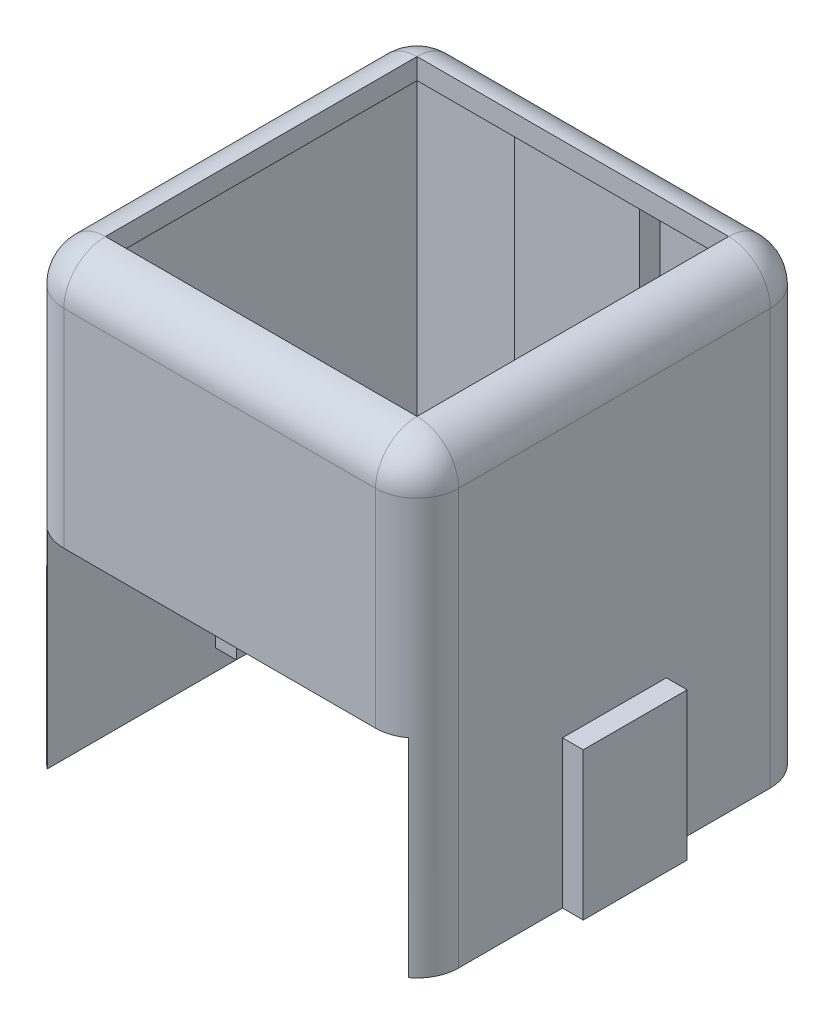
ISO-10303-21;
HEADER;
FILE_DESCRIPTION(('STEP AP214'),'2;1');
FILE_NAME('part.step','',(''),(''),'','','');
FILE_SCHEMA(('AUTOMOTIVE_DESIGN { 1 0 10303 214 1 1 1 1 }'));
ENDSEC;
DATA;
#1=APPLICATION_CONTEXT('core data for automotive mechanical design processes');
#2=APPLICATION_PROTOCOL_DEFINITION('international standard','automotive_design',2000,#1);
#3=PRODUCT_CONTEXT('',#1,'mechanical');
#4=PRODUCT('Part','Part','',(#3));
#5=PRODUCT_RELATED_PRODUCT_CATEGORY('part','',(#4));
#6=PRODUCT_DEFINITION_FORMATION('','',#4);
#7=PRODUCT_DEFINITION_CONTEXT('part definition',#1,'design');
#8=PRODUCT_DEFINITION('design','',#6,#7);
#9=PRODUCT_DEFINITION_SHAPE('','',#8);
#10=(LENGTH_UNIT() NAMED_UNIT(*) SI_UNIT(.MILLI.,.METRE.));
#11=(NAMED_UNIT(*) PLANE_ANGLE_UNIT() SI_UNIT($,.RADIAN.));
#12=(NAMED_UNIT(*) SI_UNIT($,.STERADIAN.) SOLID_ANGLE_UNIT());
#13=UNCERTAINTY_MEASURE_WITH_UNIT(LENGTH_MEASURE(1.E-05),#10,'distance_accuracy_value','');
#14=(GEOMETRIC_REPRESENTATION_CONTEXT(3) GLOBAL_UNCERTAINTY_ASSIGNED_CONTEXT((#13)) GLOBAL_UNIT_ASSIGNED_CONTEXT((#10,
#11,#12)) REPRESENTATION_CONTEXT('',''));
#15=CARTESIAN_POINT('',(0.,0.,0.));
#16=DIRECTION('',(0.,0.,1.));
#17=DIRECTION('',(1.,0.,0.));
#18=AXIS2_PLACEMENT_3D('',#15,#16,#17);
#19=CARTESIAN_POINT('',(-8.7,0.,8.7));
#20=DIRECTION('',(-1.,0.,0.));
#21=DIRECTION('',(0.,0.,1.));
#22=AXIS2_PLACEMENT_3D('',#19,#20,#21);
#23=PLANE('',#22);
#24=DIRECTION('',(0.,0.,1.));
#25=VECTOR('',#24,1.);
#26=CARTESIAN_POINT('',(-8.7,10.,7.5));
#27=LINE('',#26,#25);
#28=CARTESIAN_POINT('',(-8.7,10.,8.7));
#29=VERTEX_POINT('',#28);
#30=CARTESIAN_POINT('',(-8.7,10.,9.1));
#31=VERTEX_POINT('',#30);
#32=EDGE_CURVE('E576',#29,#31,#27,.T.);
#33=ORIENTED_EDGE('',*,*,#32,.T.);
#34=DIRECTION('',(0.,1.,0.));
#35=VECTOR('',#34,1.);
#36=CARTESIAN_POINT('',(-8.7,10.,9.1));
#37=LINE('',#36,#35);
#38=CARTESIAN_POINT('',(-8.7,0.,9.10000000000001));
#39=VERTEX_POINT('',#38);
#40=EDGE_CURVE('E688',#31,#39,#37,.F.);
#41=ORIENTED_EDGE('',*,*,#40,.T.);
#42=DIRECTION('',(0.,0.,1.));
#43=VECTOR('',#42,1.);
#44=CARTESIAN_POINT('',(-8.7,0.,8.7));
#45=LINE('',#44,#43);
#46=CARTESIAN_POINT('',(-8.7,0.,-8.7));
#47=VERTEX_POINT('',#46);
#48=EDGE_CURVE('E612',#47,#39,#45,.T.);
#49=ORIENTED_EDGE('',*,*,#48,.F.);
#50=DIRECTION('',(0.,1.,0.));
#51=VECTOR('',#50,1.);
#52=CARTESIAN_POINT('',(-8.7,0.,-8.7));
#53=LINE('',#52,#51);
#54=CARTESIAN_POINT('',(-8.7,21.,-8.7));
#55=VERTEX_POINT('',#54);
#56=EDGE_CURVE('E634',#47,#55,#53,.T.);
#57=ORIENTED_EDGE('',*,*,#56,.T.);
#58=DIRECTION('',(0.,0.,1.));
#59=VECTOR('',#58,1.);
#60=CARTESIAN_POINT('',(-8.7,21.,8.7));
#61=LINE('',#60,#59);
#62=CARTESIAN_POINT('',(-8.7,21.,8.7));
#63=VERTEX_POINT('',#62);
#64=EDGE_CURVE('E622',#55,#63,#61,.T.);
#65=ORIENTED_EDGE('',*,*,#64,.T.);
#66=DIRECTION('',(0.,1.,0.));
#67=VECTOR('',#66,1.);
#68=CARTESIAN_POINT('',(-8.7,0.,8.7));
#69=LINE('',#68,#67);
#70=EDGE_CURVE('E632',#29,#63,#69,.T.);
#71=ORIENTED_EDGE('',*,*,#70,.F.);
#72=EDGE_LOOP('',(#33,#41,#49,#57,#65,#71));
#73=FACE_BOUND('',#72,.T.);
#74=DIRECTION('',(0.,0.,1.));
#75=VECTOR('',#74,1.);
#76=CARTESIAN_POINT('',(-8.7,3.,-1.));
#77=LINE('',#76,#75);
#78=CARTESIAN_POINT('',(-8.7,3.,-1.));
#79=VERTEX_POINT('',#78);
#80=CARTESIAN_POINT('',(-8.7,3.,1.));
#81=VERTEX_POINT('',#80);
#82=EDGE_CURVE('E382',#79,#81,#77,.T.);
#83=ORIENTED_EDGE('',*,*,#82,.F.);
#84=DIRECTION('',(0.,-1.,0.));
#85=VECTOR('',#84,1.);
#86=CARTESIAN_POINT('',(-8.7,3.,-1.));
#87=LINE('',#86,#85);
#88=CARTESIAN_POINT('',(-8.7,1.,-1.));
#89=VERTEX_POINT('',#88);
#90=EDGE_CURVE('E391',#79,#89,#87,.T.);
#91=ORIENTED_EDGE('',*,*,#90,.T.);
#92=DIRECTION('',(0.,0.,1.));
#93=VECTOR('',#92,1.);
#94=CARTESIAN_POINT('',(-8.7,1.,-1.));
#95=LINE('',#94,#93);
#96=CARTESIAN_POINT('',(-8.7,1.,1.));
#97=VERTEX_POINT('',#96);
#98=EDGE_CURVE('E369',#89,#97,#95,.T.);
#99=ORIENTED_EDGE('',*,*,#98,.T.);
#100=DIRECTION('',(0.,-1.,0.));
#101=VECTOR('',#100,1.);
#102=CARTESIAN_POINT('',(-8.7,3.,1.));
#103=LINE('',#102,#101);
#104=EDGE_CURVE('E405',#81,#97,#103,.T.);
#105=ORIENTED_EDGE('',*,*,#104,.F.);
#106=EDGE_LOOP('',(#83,#91,#99,#105));
#107=FACE_BOUND('',#106,.T.);
#108=ADVANCED_FACE('F41',(#73,#107),#23,.F.);
#109=CARTESIAN_POINT('',(0.,10.,0.));
#110=DIRECTION('',(0.,1.,0.));
#111=DIRECTION('',(0.,0.,1.));
#112=AXIS2_PLACEMENT_3D('',#109,#110,#111);
#113=PLANE('',#112);
#114=DIRECTION('',(1.,0.,0.));
#115=VECTOR('',#114,1.);
#116=CARTESIAN_POINT('',(-3.,10.,-7.7));
#117=LINE('',#116,#115);
#118=CARTESIAN_POINT('',(2.,10.,-7.7));
#119=VERTEX_POINT('',#118);
#120=CARTESIAN_POINT('',(3.,10.,-7.7));
#121=VERTEX_POINT('',#120);
#122=EDGE_CURVE('E447',#119,#121,#117,.T.);
#123=ORIENTED_EDGE('',*,*,#122,.F.);
#124=DIRECTION('',(0.,0.,1.));
#125=VECTOR('',#124,1.);
#126=CARTESIAN_POINT('',(2.,10.,9.501));
#127=LINE('',#126,#125);
#128=CARTESIAN_POINT('',(2.,10.,-8.7));
#129=VERTEX_POINT('',#128);
#130=EDGE_CURVE('E443',#129,#119,#127,.T.);
#131=ORIENTED_EDGE('',*,*,#130,.F.);
#132=DIRECTION('',(-1.,0.,0.));
#133=VECTOR('',#132,1.);
#134=CARTESIAN_POINT('',(-3.,10.,-8.7));
#135=LINE('',#134,#133);
#136=CARTESIAN_POINT('',(3.,10.,-8.7));
#137=VERTEX_POINT('',#136);
#138=EDGE_CURVE('E469',#137,#129,#135,.T.);
#139=ORIENTED_EDGE('',*,*,#138,.F.);
#140=DIRECTION('',(0.,0.,-1.));
#141=VECTOR('',#140,1.);
#142=CARTESIAN_POINT('',(3.,10.,-7.7));
#143=LINE('',#142,#141);
#144=EDGE_CURVE('E460',#121,#137,#143,.T.);
#145=ORIENTED_EDGE('',*,*,#144,.F.);
#146=EDGE_LOOP('',(#123,#131,#139,#145));
#147=FACE_BOUND('',#146,.T.);
#148=ADVANCED_FACE('F840',(#147),#113,.F.);
#149=CARTESIAN_POINT('',(0.,21.,0.));
#150=DIRECTION('',(0.,-1.,0.));
#151=DIRECTION('',(0.,0.,-1.));
#152=AXIS2_PLACEMENT_3D('',#149,#150,#151);
#153=PLANE('',#152);
#154=DIRECTION('',(0.,0.,1.));
#155=VECTOR('',#154,1.);
#156=CARTESIAN_POINT('',(7.5,21.,0.));
#157=LINE('',#156,#155);
#158=CARTESIAN_POINT('',(7.5,21.,-7.5));
#159=VERTEX_POINT('',#158);
#160=CARTESIAN_POINT('',(7.5,21.,7.5));
#161=VERTEX_POINT('',#160);
#162=EDGE_CURVE('E653',#159,#161,#157,.T.);
#163=ORIENTED_EDGE('',*,*,#162,.F.);
#164=DIRECTION('',(1.,0.,0.));
#165=VECTOR('',#164,1.);
#166=CARTESIAN_POINT('',(0.,21.,-7.5));
#167=LINE('',#166,#165);
#168=CARTESIAN_POINT('',(-7.5,21.,-7.5));
#169=VERTEX_POINT('',#168);
#170=EDGE_CURVE('E646',#169,#159,#167,.T.);
#171=ORIENTED_EDGE('',*,*,#170,.F.);
#172=DIRECTION('',(0.,0.,-1.));
#173=VECTOR('',#172,1.);
#174=CARTESIAN_POINT('',(-7.5,21.,0.));
#175=LINE('',#174,#173);
#176=CARTESIAN_POINT('',(-7.5,21.,7.5));
#177=VERTEX_POINT('',#176);
#178=EDGE_CURVE('E648',#177,#169,#175,.T.);
#179=ORIENTED_EDGE('',*,*,#178,.F.);
#180=DIRECTION('',(-1.,0.,0.));
#181=VECTOR('',#180,1.);
#182=CARTESIAN_POINT('',(0.,21.,7.5));
#183=LINE('',#182,#181);
#184=EDGE_CURVE('E651',#161,#177,#183,.T.);
#185=ORIENTED_EDGE('',*,*,#184,.F.);
#186=EDGE_LOOP('',(#163,#171,#179,#185));
#187=FACE_BOUND('',#186,.T.);
#188=DIRECTION('',(-1.,0.,0.));
#189=VECTOR('',#188,1.);
#190=CARTESIAN_POINT('',(-3.,21.,-7.7));
#191=LINE('',#190,#189);
#192=CARTESIAN_POINT('',(3.,21.,-7.7));
#193=VERTEX_POINT('',#192);
#194=CARTESIAN_POINT('',(-3.,21.,-7.7));
#195=VERTEX_POINT('',#194);
#196=EDGE_CURVE('E475',#193,#195,#191,.T.);
#197=ORIENTED_EDGE('',*,*,#196,.F.);
#198=DIRECTION('',(0.,0.,1.));
#199=VECTOR('',#198,1.);
#200=CARTESIAN_POINT('',(3.,21.,-7.7));
#201=LINE('',#200,#199);
#202=CARTESIAN_POINT('',(3.,21.,-8.7));
#203=VERTEX_POINT('',#202);
#204=EDGE_CURVE('E474',#203,#193,#201,.T.);
#205=ORIENTED_EDGE('',*,*,#204,.F.);
#206=DIRECTION('',(-1.,0.,0.));
#207=VECTOR('',#206,1.);
#208=CARTESIAN_POINT('',(-8.7,21.,-8.7));
#209=LINE('',#208,#207);
#210=CARTESIAN_POINT('',(8.7,21.,-8.7));
#211=VERTEX_POINT('',#210);
#212=EDGE_CURVE('E619',#211,#203,#209,.T.);
#213=ORIENTED_EDGE('',*,*,#212,.F.);
#214=DIRECTION('',(0.,0.,-1.));
#215=VECTOR('',#214,1.);
#216=CARTESIAN_POINT('',(8.7,21.,8.7));
#217=LINE('',#216,#215);
#218=CARTESIAN_POINT('',(8.7,21.,8.7));
#219=VERTEX_POINT('',#218);
#220=EDGE_CURVE('E599',#219,#211,#217,.T.);
#221=ORIENTED_EDGE('',*,*,#220,.F.);
#222=DIRECTION('',(1.,0.,0.));
#223=VECTOR('',#222,1.);
#224=CARTESIAN_POINT('',(-8.7,21.,8.7));
#225=LINE('',#224,#223);
#226=CARTESIAN_POINT('',(3.,21.,8.7));
#227=VERTEX_POINT('',#226);
#228=EDGE_CURVE('E625',#227,#219,#225,.T.);
#229=ORIENTED_EDGE('',*,*,#228,.F.);
#230=DIRECTION('',(0.,0.,1.));
#231=VECTOR('',#230,1.);
#232=CARTESIAN_POINT('',(3.,21.,7.7));
#233=LINE('',#232,#231);
#234=CARTESIAN_POINT('',(3.,21.,7.7));
#235=VERTEX_POINT('',#234);
#236=EDGE_CURVE('E478',#235,#227,#233,.T.);
#237=ORIENTED_EDGE('',*,*,#236,.F.);
#238=DIRECTION('',(1.,0.,0.));
#239=VECTOR('',#238,1.);
#240=CARTESIAN_POINT('',(-3.,21.,7.7));
#241=LINE('',#240,#239);
#242=CARTESIAN_POINT('',(-3.,21.,7.7));
#243=VERTEX_POINT('',#242);
#244=EDGE_CURVE('E483',#243,#235,#241,.T.);
#245=ORIENTED_EDGE('',*,*,#244,.F.);
#246=DIRECTION('',(0.,0.,-1.));
#247=VECTOR('',#246,1.);
#248=CARTESIAN_POINT('',(-3.,21.,7.7));
#249=LINE('',#248,#247);
#250=CARTESIAN_POINT('',(-3.,21.,8.7));
#251=VERTEX_POINT('',#250);
#252=EDGE_CURVE('E486',#251,#243,#249,.T.);
#253=ORIENTED_EDGE('',*,*,#252,.F.);
#254=EDGE_CURVE('E609',#63,#251,#225,.T.);
#255=ORIENTED_EDGE('',*,*,#254,.F.);
#256=ORIENTED_EDGE('',*,*,#64,.F.);
#257=CARTESIAN_POINT('',(-3.,21.,-8.7));
#258=VERTEX_POINT('',#257);
#259=EDGE_CURVE('E618',#258,#55,#209,.T.);
#260=ORIENTED_EDGE('',*,*,#259,.F.);
#261=DIRECTION('',(0.,0.,-1.));
#262=VECTOR('',#261,1.);
#263=CARTESIAN_POINT('',(-3.,21.,-7.7));
#264=LINE('',#263,#262);
#265=EDGE_CURVE('E459',#195,#258,#264,.T.);
#266=ORIENTED_EDGE('',*,*,#265,.F.);
#267=EDGE_LOOP('',(#197,#205,#213,#221,#229,#237,#245,#253,#255,#256,#260,#266));
#268=FACE_BOUND('',#267,.T.);
#269=ADVANCED_FACE('F836',(#187,#268),#153,.T.);
#270=CARTESIAN_POINT('',(-8.7,0.,-8.7));
#271=DIRECTION('',(0.,0.,-1.));
#272=DIRECTION('',(-1.,0.,0.));
#273=AXIS2_PLACEMENT_3D('',#270,#271,#272);
#274=PLANE('',#273);
#275=ORIENTED_EDGE('',*,*,#138,.T.);
#276=DIRECTION('',(0.,1.,0.));
#277=VECTOR('',#276,1.);
#278=CARTESIAN_POINT('',(2.,9.59999999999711,-8.7));
#279=LINE('',#278,#277);
#280=CARTESIAN_POINT('',(2.,9.59999999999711,-8.7));
#281=VERTEX_POINT('',#280);
#282=EDGE_CURVE('E445',#281,#129,#279,.T.);
#283=ORIENTED_EDGE('',*,*,#282,.F.);
#284=DIRECTION('',(1.,0.,0.));
#285=VECTOR('',#284,1.);
#286=CARTESIAN_POINT('',(2.,9.59999999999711,-8.7));
#287=LINE('',#286,#285);
#288=CARTESIAN_POINT('',(-2.,9.59999999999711,-8.7));
#289=VERTEX_POINT('',#288);
#290=EDGE_CURVE('E414',#289,#281,#287,.T.);
#291=ORIENTED_EDGE('',*,*,#290,.F.);
#292=DIRECTION('',(0.,-1.,0.));
#293=VECTOR('',#292,1.);
#294=CARTESIAN_POINT('',(-2.,9.59999999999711,-8.7));
#295=LINE('',#294,#293);
#296=CARTESIAN_POINT('',(-2.,10.,-8.7));
#297=VERTEX_POINT('',#296);
#298=EDGE_CURVE('E417',#297,#289,#295,.T.);
#299=ORIENTED_EDGE('',*,*,#298,.F.);
#300=CARTESIAN_POINT('',(-3.,10.,-8.7));
#301=VERTEX_POINT('',#300);
#302=EDGE_CURVE('E463',#297,#301,#135,.T.);
#303=ORIENTED_EDGE('',*,*,#302,.T.);
#304=DIRECTION('',(0.,-1.,0.));
#305=VECTOR('',#304,1.);
#306=CARTESIAN_POINT('',(-3.,22.002,-8.7));
#307=LINE('',#306,#305);
#308=EDGE_CURVE('E450',#258,#301,#307,.T.);
#309=ORIENTED_EDGE('',*,*,#308,.F.);
#310=ORIENTED_EDGE('',*,*,#259,.T.);
#311=ORIENTED_EDGE('',*,*,#56,.F.);
#312=DIRECTION('',(-1.,0.,0.));
#313=VECTOR('',#312,1.);
#314=CARTESIAN_POINT('',(-8.7,0.,-8.7));
#315=LINE('',#314,#313);
#316=CARTESIAN_POINT('',(8.7,0.,-8.7));
#317=VERTEX_POINT('',#316);
#318=EDGE_CURVE('E608',#317,#47,#315,.T.);
#319=ORIENTED_EDGE('',*,*,#318,.F.);
#320=DIRECTION('',(0.,1.,0.));
#321=VECTOR('',#320,1.);
#322=CARTESIAN_POINT('',(8.7,0.,-8.7));
#323=LINE('',#322,#321);
#324=EDGE_CURVE('E615',#317,#211,#323,.T.);
#325=ORIENTED_EDGE('',*,*,#324,.T.);
#326=ORIENTED_EDGE('',*,*,#212,.T.);
#327=DIRECTION('',(0.,-1.,0.));
#328=VECTOR('',#327,1.);
#329=CARTESIAN_POINT('',(3.,22.002,-8.7));
#330=LINE('',#329,#328);
#331=EDGE_CURVE('E454',#203,#137,#330,.T.);
#332=ORIENTED_EDGE('',*,*,#331,.T.);
#333=EDGE_LOOP('',(#275,#283,#291,#299,#303,#309,#310,#311,#319,#325,#326,#332));
#334=FACE_BOUND('',#333,.T.);
#335=ADVANCED_FACE('F839',(#334),#274,.F.);
#336=CARTESIAN_POINT('',(-8.7,0.,8.7));
#337=DIRECTION('',(0.,0.,1.));
#338=DIRECTION('',(1.,0.,0.));
#339=AXIS2_PLACEMENT_3D('',#336,#337,#338);
#340=PLANE('',#339);
#341=DIRECTION('',(0.,-1.,0.));
#342=VECTOR('',#341,1.);
#343=CARTESIAN_POINT('',(-3.,22.002,8.7));
#344=LINE('',#343,#342);
#345=CARTESIAN_POINT('',(-3.,10.,8.7));
#346=VERTEX_POINT('',#345);
#347=EDGE_CURVE('E504',#251,#346,#344,.T.);
#348=ORIENTED_EDGE('',*,*,#347,.T.);
#349=DIRECTION('',(-1.,0.,0.));
#350=VECTOR('',#349,1.);
#351=CARTESIAN_POINT('',(-8.7,10.,8.7));
#352=LINE('',#351,#350);
#353=EDGE_CURVE('E579',#346,#29,#352,.T.);
#354=ORIENTED_EDGE('',*,*,#353,.T.);
#355=ORIENTED_EDGE('',*,*,#70,.T.);
#356=ORIENTED_EDGE('',*,*,#254,.T.);
#357=EDGE_LOOP('',(#348,#354,#355,#356));
#358=FACE_BOUND('',#357,.T.);
#359=ADVANCED_FACE('F885',(#358),#340,.F.);
#360=DIRECTION('',(0.,-1.,0.));
#361=VECTOR('',#360,1.);
#362=CARTESIAN_POINT('',(3.,22.002,8.7));
#363=LINE('',#362,#361);
#364=CARTESIAN_POINT('',(3.,10.,8.7));
#365=VERTEX_POINT('',#364);
#366=EDGE_CURVE('E498',#227,#365,#363,.T.);
#367=ORIENTED_EDGE('',*,*,#366,.F.);
#368=ORIENTED_EDGE('',*,*,#228,.T.);
#369=DIRECTION('',(0.,1.,0.));
#370=VECTOR('',#369,1.);
#371=CARTESIAN_POINT('',(8.7,0.,8.7));
#372=LINE('',#371,#370);
#373=CARTESIAN_POINT('',(8.7,10.,8.7));
#374=VERTEX_POINT('',#373);
#375=EDGE_CURVE('E628',#374,#219,#372,.T.);
#376=ORIENTED_EDGE('',*,*,#375,.F.);
#377=EDGE_CURVE('E582',#374,#365,#352,.T.);
#378=ORIENTED_EDGE('',*,*,#377,.T.);
#379=EDGE_LOOP('',(#367,#368,#376,#378));
#380=FACE_BOUND('',#379,.T.);
#381=ADVANCED_FACE('F869',(#380),#340,.F.);
#382=CARTESIAN_POINT('',(9.49999999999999,22.,9.5));
#383=DIRECTION('',(-1.,0.,0.));
#384=DIRECTION('',(0.,0.,1.));
#385=AXIS2_PLACEMENT_3D('',#382,#383,#384);
#386=PLANE('',#385);
#387=DIRECTION('',(0.,0.,-1.));
#388=VECTOR('',#387,1.);
#389=CARTESIAN_POINT('',(9.49999999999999,0.,9.5));
#390=LINE('',#389,#388);
#391=CARTESIAN_POINT('',(9.49999999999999,0.,-2.49999999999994));
#392=VERTEX_POINT('',#391);
#393=CARTESIAN_POINT('',(9.49999999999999,0.,-7.5));
#394=VERTEX_POINT('',#393);
#395=EDGE_CURVE('E640',#392,#394,#390,.T.);
#396=ORIENTED_EDGE('',*,*,#395,.T.);
#397=DIRECTION('',(0.,-1.,0.));
#398=VECTOR('',#397,1.);
#399=CARTESIAN_POINT('',(9.49999999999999,22.,-7.5));
#400=LINE('',#399,#398);
#401=CARTESIAN_POINT('',(9.49999999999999,20.,-7.5));
#402=VERTEX_POINT('',#401);
#403=EDGE_CURVE('E674',#394,#402,#400,.F.);
#404=ORIENTED_EDGE('',*,*,#403,.T.);
#405=DIRECTION('',(0.,0.,-1.));
#406=VECTOR('',#405,1.);
#407=CARTESIAN_POINT('',(9.49999999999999,20.,9.5));
#408=LINE('',#407,#406);
#409=CARTESIAN_POINT('',(9.49999999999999,20.,7.5));
#410=VERTEX_POINT('',#409);
#411=EDGE_CURVE('E670',#402,#410,#408,.F.);
#412=ORIENTED_EDGE('',*,*,#411,.T.);
#413=DIRECTION('',(0.,-1.,0.));
#414=VECTOR('',#413,1.);
#415=CARTESIAN_POINT('',(9.49999999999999,22.,7.5));
#416=LINE('',#415,#414);
#417=CARTESIAN_POINT('',(9.49999999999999,0.,7.5));
#418=VERTEX_POINT('',#417);
#419=EDGE_CURVE('E672',#410,#418,#416,.T.);
#420=ORIENTED_EDGE('',*,*,#419,.T.);
#421=CARTESIAN_POINT('',(9.50000000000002,0.,2.49999999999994));
#422=VERTEX_POINT('',#421);
#423=EDGE_CURVE('E641',#418,#422,#390,.T.);
#424=ORIENTED_EDGE('',*,*,#423,.T.);
#425=DIRECTION('',(0.,1.,0.));
#426=VECTOR('',#425,1.);
#427=CARTESIAN_POINT('',(9.50000000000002,0.,2.49999999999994));
#428=LINE('',#427,#426);
#429=CARTESIAN_POINT('',(9.50000000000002,7.1,2.49999999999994));
#430=VERTEX_POINT('',#429);
#431=EDGE_CURVE('E516',#422,#430,#428,.T.);
#432=ORIENTED_EDGE('',*,*,#431,.T.);
#433=DIRECTION('',(0.,0.,1.));
#434=VECTOR('',#433,1.);
#435=CARTESIAN_POINT('',(9.50000000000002,7.1,2.49999999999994));
#436=LINE('',#435,#434);
#437=CARTESIAN_POINT('',(9.49999999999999,7.1,-2.49999999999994));
#438=VERTEX_POINT('',#437);
#439=EDGE_CURVE('E535',#438,#430,#436,.T.);
#440=ORIENTED_EDGE('',*,*,#439,.F.);
#441=DIRECTION('',(0.,1.,0.));
#442=VECTOR('',#441,1.);
#443=CARTESIAN_POINT('',(9.49999999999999,0.,-2.49999999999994));
#444=LINE('',#443,#442);
#445=EDGE_CURVE('E512',#392,#438,#444,.T.);
#446=ORIENTED_EDGE('',*,*,#445,.F.);
#447=EDGE_LOOP('',(#396,#404,#412,#420,#424,#432,#440,#446));
#448=FACE_BOUND('',#447,.T.);
#449=ADVANCED_FACE('F804',(#448),#386,.F.);
#450=CARTESIAN_POINT('',(-9.50000000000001,22.,-9.5));
#451=DIRECTION('',(0.,0.,-1.));
#452=DIRECTION('',(-1.,0.,0.));
#453=AXIS2_PLACEMENT_3D('',#450,#451,#452);
#454=PLANE('',#453);
#455=CARTESIAN_POINT('',(0.,10.0999999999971,-9.5));
#456=DIRECTION('',(0.,0.,-1.));
#457=DIRECTION('',(-1.,0.,0.));
#458=AXIS2_PLACEMENT_3D('',#455,#456,#457);
#459=CIRCLE('',#458,3.);
#460=CARTESIAN_POINT('',(-2.99999999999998,10.0999999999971,-9.5));
#461=VERTEX_POINT('',#460);
#462=EDGE_CURVE('E513',#461,#461,#459,.T.);
#463=ORIENTED_EDGE('',*,*,#462,.F.);
#464=EDGE_LOOP('',(#463));
#465=FACE_BOUND('',#464,.T.);
#466=DIRECTION('',(1.,0.,0.));
#467=VECTOR('',#466,1.);
#468=CARTESIAN_POINT('',(-9.50000000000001,20.,-9.5));
#469=LINE('',#468,#467);
#470=CARTESIAN_POINT('',(-7.50000000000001,20.,-9.5));
#471=VERTEX_POINT('',#470);
#472=CARTESIAN_POINT('',(7.5,20.,-9.5));
#473=VERTEX_POINT('',#472);
#474=EDGE_CURVE('E657',#471,#473,#469,.T.);
#475=ORIENTED_EDGE('',*,*,#474,.T.);
#476=DIRECTION('',(0.,-1.,0.));
#477=VECTOR('',#476,1.);
#478=CARTESIAN_POINT('',(7.5,0.,-9.5));
#479=LINE('',#478,#477);
#480=CARTESIAN_POINT('',(7.5,0.,-9.5));
#481=VERTEX_POINT('',#480);
#482=EDGE_CURVE('E659',#473,#481,#479,.T.);
#483=ORIENTED_EDGE('',*,*,#482,.T.);
#484=DIRECTION('',(1.,0.,0.));
#485=VECTOR('',#484,1.);
#486=CARTESIAN_POINT('',(-9.50000000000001,0.,-9.5));
#487=LINE('',#486,#485);
#488=CARTESIAN_POINT('',(-7.50000000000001,0.,-9.5));
#489=VERTEX_POINT('',#488);
#490=EDGE_CURVE('E631',#489,#481,#487,.T.);
#491=ORIENTED_EDGE('',*,*,#490,.F.);
#492=DIRECTION('',(0.,-1.,0.));
#493=VECTOR('',#492,1.);
#494=CARTESIAN_POINT('',(-7.50000000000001,22.,-9.5));
#495=LINE('',#494,#493);
#496=EDGE_CURVE('E655',#489,#471,#495,.F.);
#497=ORIENTED_EDGE('',*,*,#496,.T.);
#498=EDGE_LOOP('',(#475,#483,#491,#497));
#499=FACE_BOUND('',#498,.T.);
#500=ADVANCED_FACE('F791',(#465,#499),#454,.T.);
#501=CARTESIAN_POINT('',(-9.50000000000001,22.,9.5));
#502=DIRECTION('',(-1.,0.,0.));
#503=DIRECTION('',(0.,0.,1.));
#504=AXIS2_PLACEMENT_3D('',#501,#502,#503);
#505=PLANE('',#504);
#506=DIRECTION('',(0.,0.,-1.));
#507=VECTOR('',#506,1.);
#508=CARTESIAN_POINT('',(-9.50000000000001,0.,9.5));
#509=LINE('',#508,#507);
#510=CARTESIAN_POINT('',(-9.50000000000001,0.,7.5));
#511=VERTEX_POINT('',#510);
#512=CARTESIAN_POINT('',(-9.50000000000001,0.,2.49999999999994));
#513=VERTEX_POINT('',#512);
#514=EDGE_CURVE('E644',#511,#513,#509,.T.);
#515=ORIENTED_EDGE('',*,*,#514,.F.);
#516=DIRECTION('',(0.,-1.,0.));
#517=VECTOR('',#516,1.);
#518=CARTESIAN_POINT('',(-9.50000000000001,22.,7.5));
#519=LINE('',#518,#517);
#520=CARTESIAN_POINT('',(-9.50000000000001,20.,7.5));
#521=VERTEX_POINT('',#520);
#522=EDGE_CURVE('E11',#511,#521,#519,.F.);
#523=ORIENTED_EDGE('',*,*,#522,.T.);
#524=DIRECTION('',(0.,0.,-1.));
#525=VECTOR('',#524,1.);
#526=CARTESIAN_POINT('',(-9.50000000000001,20.,9.5));
#527=LINE('',#526,#525);
#528=CARTESIAN_POINT('',(-9.50000000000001,20.,-7.5));
#529=VERTEX_POINT('',#528);
#530=EDGE_CURVE('E50',#521,#529,#527,.T.);
#531=ORIENTED_EDGE('',*,*,#530,.T.);
#532=DIRECTION('',(0.,-1.,0.));
#533=VECTOR('',#532,1.);
#534=CARTESIAN_POINT('',(-9.50000000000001,22.,-7.5));
#535=LINE('',#534,#533);
#536=CARTESIAN_POINT('',(-9.50000000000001,0.,-7.5));
#537=VERTEX_POINT('',#536);
#538=EDGE_CURVE('E690',#529,#537,#535,.T.);
#539=ORIENTED_EDGE('',*,*,#538,.T.);
#540=CARTESIAN_POINT('',(-9.50000000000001,0.,-2.49999999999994));
#541=VERTEX_POINT('',#540);
#542=EDGE_CURVE('E643',#541,#537,#509,.T.);
#543=ORIENTED_EDGE('',*,*,#542,.F.);
#544=DIRECTION('',(0.,1.,0.));
#545=VECTOR('',#544,1.);
#546=CARTESIAN_POINT('',(-9.50000000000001,0.,-2.49999999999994));
#547=LINE('',#546,#545);
#548=CARTESIAN_POINT('',(-9.50000000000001,7.1,-2.49999999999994));
#549=VERTEX_POINT('',#548);
#550=EDGE_CURVE('E554',#541,#549,#547,.T.);
#551=ORIENTED_EDGE('',*,*,#550,.T.);
#552=DIRECTION('',(0.,0.,-1.));
#553=VECTOR('',#552,1.);
#554=CARTESIAN_POINT('',(-9.50000000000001,7.1,2.49999999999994));
#555=LINE('',#554,#553);
#556=CARTESIAN_POINT('',(-9.50000000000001,7.1,2.49999999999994));
#557=VERTEX_POINT('',#556);
#558=EDGE_CURVE('E537',#557,#549,#555,.T.);
#559=ORIENTED_EDGE('',*,*,#558,.F.);
#560=DIRECTION('',(0.,1.,0.));
#561=VECTOR('',#560,1.);
#562=CARTESIAN_POINT('',(-9.50000000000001,0.,2.49999999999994));
#563=LINE('',#562,#561);
#564=EDGE_CURVE('E564',#513,#557,#563,.T.);
#565=ORIENTED_EDGE('',*,*,#564,.F.);
#566=EDGE_LOOP('',(#515,#523,#531,#539,#543,#551,#559,#565));
#567=FACE_BOUND('',#566,.T.);
#568=ADVANCED_FACE('F777',(#567),#505,.T.);
#569=CARTESIAN_POINT('',(-9.50000000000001,22.,9.5));
#570=DIRECTION('',(0.,0.,-1.));
#571=DIRECTION('',(-1.,0.,0.));
#572=AXIS2_PLACEMENT_3D('',#569,#570,#571);
#573=PLANE('',#572);
#574=DIRECTION('',(-1.,0.,0.));
#575=VECTOR('',#574,1.);
#576=CARTESIAN_POINT('',(-8.7,10.,9.5));
#577=LINE('',#576,#575);
#578=CARTESIAN_POINT('',(7.49999999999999,10.,9.5));
#579=VERTEX_POINT('',#578);
#580=CARTESIAN_POINT('',(-7.50000000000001,10.,9.5));
#581=VERTEX_POINT('',#580);
#582=EDGE_CURVE('E566',#579,#581,#577,.T.);
#583=ORIENTED_EDGE('',*,*,#582,.F.);
#584=DIRECTION('',(0.,-1.,0.));
#585=VECTOR('',#584,1.);
#586=CARTESIAN_POINT('',(7.5,22.,9.5));
#587=LINE('',#586,#585);
#588=CARTESIAN_POINT('',(7.49999999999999,20.,9.5));
#589=VERTEX_POINT('',#588);
#590=EDGE_CURVE('E686',#579,#589,#587,.F.);
#591=ORIENTED_EDGE('',*,*,#590,.T.);
#592=DIRECTION('',(1.,0.,0.));
#593=VECTOR('',#592,1.);
#594=CARTESIAN_POINT('',(-9.50000000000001,20.,9.5));
#595=LINE('',#594,#593);
#596=CARTESIAN_POINT('',(-7.50000000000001,20.,9.5));
#597=VERTEX_POINT('',#596);
#598=EDGE_CURVE('E682',#589,#597,#595,.F.);
#599=ORIENTED_EDGE('',*,*,#598,.T.);
#600=DIRECTION('',(0.,-1.,0.));
#601=VECTOR('',#600,1.);
#602=CARTESIAN_POINT('',(-7.50000000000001,0.,9.5));
#603=LINE('',#602,#601);
#604=EDGE_CURVE('E684',#597,#581,#603,.T.);
#605=ORIENTED_EDGE('',*,*,#604,.T.);
#606=EDGE_LOOP('',(#583,#591,#599,#605));
#607=FACE_BOUND('',#606,.T.);
#608=ADVANCED_FACE('F741',(#607),#573,.F.);
#609=CARTESIAN_POINT('',(0.,0.,0.));
#610=DIRECTION('',(0.,1.,0.));
#611=DIRECTION('',(0.,0.,1.));
#612=AXIS2_PLACEMENT_3D('',#609,#610,#611);
#613=PLANE('',#612);
#614=ORIENTED_EDGE('',*,*,#490,.T.);
#615=CARTESIAN_POINT('',(7.5,0.,-7.5));
#616=DIRECTION('',(0.,1.,0.));
#617=DIRECTION('',(0.,0.,1.));
#618=AXIS2_PLACEMENT_3D('',#615,#616,#617);
#619=CIRCLE('',#618,2.);
#620=EDGE_CURVE('E668',#481,#394,#619,.F.);
#621=ORIENTED_EDGE('',*,*,#620,.T.);
#622=ORIENTED_EDGE('',*,*,#395,.F.);
#623=DIRECTION('',(-1.,0.,0.));
#624=VECTOR('',#623,1.);
#625=CARTESIAN_POINT('',(9.49999999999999,0.,-2.49999999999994));
#626=LINE('',#625,#624);
#627=CARTESIAN_POINT('',(10.5,0.,-2.5));
#628=VERTEX_POINT('',#627);
#629=EDGE_CURVE('E519',#628,#392,#626,.T.);
#630=ORIENTED_EDGE('',*,*,#629,.F.);
#631=DIRECTION('',(0.,0.,-1.));
#632=VECTOR('',#631,1.);
#633=CARTESIAN_POINT('',(10.5,0.,2.5));
#634=LINE('',#633,#632);
#635=CARTESIAN_POINT('',(10.5,0.,2.5));
#636=VERTEX_POINT('',#635);
#637=EDGE_CURVE('E539',#636,#628,#634,.T.);
#638=ORIENTED_EDGE('',*,*,#637,.F.);
#639=DIRECTION('',(1.,0.,0.));
#640=VECTOR('',#639,1.);
#641=CARTESIAN_POINT('',(9.50000000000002,0.,2.49999999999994));
#642=LINE('',#641,#640);
#643=EDGE_CURVE('E529',#422,#636,#642,.T.);
#644=ORIENTED_EDGE('',*,*,#643,.F.);
#645=ORIENTED_EDGE('',*,*,#423,.F.);
#646=CARTESIAN_POINT('',(7.49999999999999,0.,7.5));
#647=DIRECTION('',(0.,1.,0.));
#648=DIRECTION('',(0.,0.,1.));
#649=AXIS2_PLACEMENT_3D('',#646,#647,#648);
#650=CIRCLE('',#649,2.);
#651=CARTESIAN_POINT('',(8.7,0.,9.1));
#652=VERTEX_POINT('',#651);
#653=EDGE_CURVE('E666',#418,#652,#650,.F.);
#654=ORIENTED_EDGE('',*,*,#653,.T.);
#655=DIRECTION('',(0.,0.,-1.));
#656=VECTOR('',#655,1.);
#657=CARTESIAN_POINT('',(8.7,0.,8.7));
#658=LINE('',#657,#656);
#659=EDGE_CURVE('E606',#652,#317,#658,.T.);
#660=ORIENTED_EDGE('',*,*,#659,.T.);
#661=ORIENTED_EDGE('',*,*,#318,.T.);
#662=ORIENTED_EDGE('',*,*,#48,.T.);
#663=CARTESIAN_POINT('',(-7.50000000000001,0.,7.5));
#664=DIRECTION('',(0.,1.,0.));
#665=DIRECTION('',(0.,0.,1.));
#666=AXIS2_PLACEMENT_3D('',#663,#664,#665);
#667=CIRCLE('',#666,2.);
#668=EDGE_CURVE('E664',#39,#511,#667,.F.);
#669=ORIENTED_EDGE('',*,*,#668,.T.);
#670=ORIENTED_EDGE('',*,*,#514,.T.);
#671=DIRECTION('',(1.,0.,0.));
#672=VECTOR('',#671,1.);
#673=CARTESIAN_POINT('',(-9.50000000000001,0.,2.49999999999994));
#674=LINE('',#673,#672);
#675=CARTESIAN_POINT('',(-10.5,0.,2.5));
#676=VERTEX_POINT('',#675);
#677=EDGE_CURVE('E551',#676,#513,#674,.T.);
#678=ORIENTED_EDGE('',*,*,#677,.F.);
#679=DIRECTION('',(0.,0.,1.));
#680=VECTOR('',#679,1.);
#681=CARTESIAN_POINT('',(-10.5,0.,2.5));
#682=LINE('',#681,#680);
#683=CARTESIAN_POINT('',(-10.5,0.,-2.5));
#684=VERTEX_POINT('',#683);
#685=EDGE_CURVE('E547',#684,#676,#682,.T.);
#686=ORIENTED_EDGE('',*,*,#685,.F.);
#687=DIRECTION('',(-1.,0.,0.));
#688=VECTOR('',#687,1.);
#689=CARTESIAN_POINT('',(-9.50000000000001,0.,-2.49999999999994));
#690=LINE('',#689,#688);
#691=EDGE_CURVE('E544',#541,#684,#690,.T.);
#692=ORIENTED_EDGE('',*,*,#691,.F.);
#693=ORIENTED_EDGE('',*,*,#542,.T.);
#694=CARTESIAN_POINT('',(-7.50000000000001,0.,-7.5));
#695=DIRECTION('',(0.,1.,0.));
#696=DIRECTION('',(0.,0.,1.));
#697=AXIS2_PLACEMENT_3D('',#694,#695,#696);
#698=CIRCLE('',#697,2.);
#699=EDGE_CURVE('E662',#537,#489,#698,.F.);
#700=ORIENTED_EDGE('',*,*,#699,.T.);
#701=EDGE_LOOP('',(#614,#621,#622,#630,#638,#644,#645,#654,#660,#661,#662,#669,#670,#678,#686,
#692,#693,#700));
#702=FACE_BOUND('',#701,.T.);
#703=ADVANCED_FACE('F788',(#702),#613,.F.);
#704=CARTESIAN_POINT('',(8.7,0.,8.7));
#705=DIRECTION('',(1.,0.,0.));
#706=DIRECTION('',(0.,0.,-1.));
#707=AXIS2_PLACEMENT_3D('',#704,#705,#706);
#708=PLANE('',#707);
#709=DIRECTION('',(0.,-1.,0.));
#710=VECTOR('',#709,1.);
#711=CARTESIAN_POINT('',(8.69999999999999,3.,-1.));
#712=LINE('',#711,#710);
#713=CARTESIAN_POINT('',(8.7,3.,-1.));
#714=VERTEX_POINT('',#713);
#715=CARTESIAN_POINT('',(8.7,1.,-1.));
#716=VERTEX_POINT('',#715);
#717=EDGE_CURVE('E63',#714,#716,#712,.T.);
#718=ORIENTED_EDGE('',*,*,#717,.F.);
#719=DIRECTION('',(0.,0.,-1.));
#720=VECTOR('',#719,1.);
#721=CARTESIAN_POINT('',(8.69999999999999,3.,-1.));
#722=LINE('',#721,#720);
#723=CARTESIAN_POINT('',(8.7,3.,1.));
#724=VERTEX_POINT('',#723);
#725=EDGE_CURVE('E58',#724,#714,#722,.T.);
#726=ORIENTED_EDGE('',*,*,#725,.F.);
#727=DIRECTION('',(0.,-1.,0.));
#728=VECTOR('',#727,1.);
#729=CARTESIAN_POINT('',(8.7,3.,1.));
#730=LINE('',#729,#728);
#731=CARTESIAN_POINT('',(8.7,1.,1.));
#732=VERTEX_POINT('',#731);
#733=EDGE_CURVE('E1391',#724,#732,#730,.T.);
#734=ORIENTED_EDGE('',*,*,#733,.T.);
#735=DIRECTION('',(0.,0.,-1.));
#736=VECTOR('',#735,1.);
#737=CARTESIAN_POINT('',(8.69999999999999,1.,-1.));
#738=LINE('',#737,#736);
#739=EDGE_CURVE('E354',#732,#716,#738,.T.);
#740=ORIENTED_EDGE('',*,*,#739,.T.);
#741=EDGE_LOOP('',(#718,#726,#734,#740));
#742=FACE_BOUND('',#741,.T.);
#743=ORIENTED_EDGE('',*,*,#659,.F.);
#744=DIRECTION('',(0.,-1.,0.));
#745=VECTOR('',#744,1.);
#746=CARTESIAN_POINT('',(8.7,0.,9.1));
#747=LINE('',#746,#745);
#748=CARTESIAN_POINT('',(8.7,10.,9.1));
#749=VERTEX_POINT('',#748);
#750=EDGE_CURVE('E676',#652,#749,#747,.F.);
#751=ORIENTED_EDGE('',*,*,#750,.T.);
#752=DIRECTION('',(0.,0.,1.));
#753=VECTOR('',#752,1.);
#754=CARTESIAN_POINT('',(8.7,10.,7.5));
#755=LINE('',#754,#753);
#756=EDGE_CURVE('E575',#374,#749,#755,.T.);
#757=ORIENTED_EDGE('',*,*,#756,.F.);
#758=ORIENTED_EDGE('',*,*,#375,.T.);
#759=ORIENTED_EDGE('',*,*,#220,.T.);
#760=ORIENTED_EDGE('',*,*,#324,.F.);
#761=EDGE_LOOP('',(#743,#751,#757,#758,#759,#760));
#762=FACE_BOUND('',#761,.T.);
#763=ADVANCED_FACE('F866',(#742,#762),#708,.F.);
#764=CARTESIAN_POINT('',(7.5,2.,7.5));
#765=DIRECTION('',(1.,0.,0.));
#766=DIRECTION('',(0.,0.,-1.));
#767=AXIS2_PLACEMENT_3D('',#764,#765,#766);
#768=PLANE('',#767);
#769=ORIENTED_EDGE('',*,*,#162,.T.);
#770=DIRECTION('',(0.,1.,0.));
#771=VECTOR('',#770,1.);
#772=CARTESIAN_POINT('',(7.5,2.,7.5));
#773=LINE('',#772,#771);
#774=CARTESIAN_POINT('',(7.5,22.,7.5));
#775=VERTEX_POINT('',#774);
#776=EDGE_CURVE('E596',#161,#775,#773,.T.);
#777=ORIENTED_EDGE('',*,*,#776,.T.);
#778=DIRECTION('',(0.,0.,-1.));
#779=VECTOR('',#778,1.);
#780=CARTESIAN_POINT('',(7.5,22.,7.5));
#781=LINE('',#780,#779);
#782=CARTESIAN_POINT('',(7.5,22.,-7.5));
#783=VERTEX_POINT('',#782);
#784=EDGE_CURVE('E584',#775,#783,#781,.T.);
#785=ORIENTED_EDGE('',*,*,#784,.T.);
#786=DIRECTION('',(0.,1.,0.));
#787=VECTOR('',#786,1.);
#788=CARTESIAN_POINT('',(7.5,2.,-7.5));
#789=LINE('',#788,#787);
#790=EDGE_CURVE('E595',#159,#783,#789,.T.);
#791=ORIENTED_EDGE('',*,*,#790,.F.);
#792=EDGE_LOOP('',(#769,#777,#785,#791));
#793=FACE_BOUND('',#792,.T.);
#794=ADVANCED_FACE('F760',(#793),#768,.F.);
#795=CARTESIAN_POINT('',(-7.5,2.,7.5));
#796=DIRECTION('',(0.,0.,1.));
#797=DIRECTION('',(1.,0.,0.));
#798=AXIS2_PLACEMENT_3D('',#795,#796,#797);
#799=PLANE('',#798);
#800=ORIENTED_EDGE('',*,*,#184,.T.);
#801=DIRECTION('',(0.,1.,0.));
#802=VECTOR('',#801,1.);
#803=CARTESIAN_POINT('',(-7.5,2.,7.5));
#804=LINE('',#803,#802);
#805=CARTESIAN_POINT('',(-7.5,22.,7.5));
#806=VERTEX_POINT('',#805);
#807=EDGE_CURVE('E600',#177,#806,#804,.T.);
#808=ORIENTED_EDGE('',*,*,#807,.T.);
#809=DIRECTION('',(1.,0.,0.));
#810=VECTOR('',#809,1.);
#811=CARTESIAN_POINT('',(-7.5,22.,7.5));
#812=LINE('',#811,#810);
#813=EDGE_CURVE('E592',#806,#775,#812,.T.);
#814=ORIENTED_EDGE('',*,*,#813,.T.);
#815=ORIENTED_EDGE('',*,*,#776,.F.);
#816=EDGE_LOOP('',(#800,#808,#814,#815));
#817=FACE_BOUND('',#816,.T.);
#818=ADVANCED_FACE('F765',(#817),#799,.F.);
#819=CARTESIAN_POINT('',(-7.5,2.,7.5));
#820=DIRECTION('',(-1.,0.,0.));
#821=DIRECTION('',(0.,0.,1.));
#822=AXIS2_PLACEMENT_3D('',#819,#820,#821);
#823=PLANE('',#822);
#824=ORIENTED_EDGE('',*,*,#178,.T.);
#825=DIRECTION('',(0.,1.,0.));
#826=VECTOR('',#825,1.);
#827=CARTESIAN_POINT('',(-7.5,2.,-7.5));
#828=LINE('',#827,#826);
#829=CARTESIAN_POINT('',(-7.5,22.,-7.5));
#830=VERTEX_POINT('',#829);
#831=EDGE_CURVE('E602',#169,#830,#828,.T.);
#832=ORIENTED_EDGE('',*,*,#831,.T.);
#833=DIRECTION('',(0.,0.,1.));
#834=VECTOR('',#833,1.);
#835=CARTESIAN_POINT('',(-7.5,22.,7.5));
#836=LINE('',#835,#834);
#837=EDGE_CURVE('E589',#830,#806,#836,.T.);
#838=ORIENTED_EDGE('',*,*,#837,.T.);
#839=ORIENTED_EDGE('',*,*,#807,.F.);
#840=EDGE_LOOP('',(#824,#832,#838,#839));
#841=FACE_BOUND('',#840,.T.);
#842=ADVANCED_FACE('F770',(#841),#823,.F.);
#843=CARTESIAN_POINT('',(-7.5,2.,-7.5));
#844=DIRECTION('',(0.,0.,-1.));
#845=DIRECTION('',(-1.,0.,0.));
#846=AXIS2_PLACEMENT_3D('',#843,#844,#845);
#847=PLANE('',#846);
#848=ORIENTED_EDGE('',*,*,#170,.T.);
#849=ORIENTED_EDGE('',*,*,#790,.T.);
#850=DIRECTION('',(-1.,0.,0.));
#851=VECTOR('',#850,1.);
#852=CARTESIAN_POINT('',(-7.5,22.,-7.5));
#853=LINE('',#852,#851);
#854=EDGE_CURVE('E586',#783,#830,#853,.T.);
#855=ORIENTED_EDGE('',*,*,#854,.T.);
#856=ORIENTED_EDGE('',*,*,#831,.F.);
#857=EDGE_LOOP('',(#848,#849,#855,#856));
#858=FACE_BOUND('',#857,.T.);
#859=ADVANCED_FACE('F833',(#858),#847,.F.);
#860=CARTESIAN_POINT('',(-8.7,10.,7.5));
#861=DIRECTION('',(0.,1.,0.));
#862=DIRECTION('',(0.,0.,1.));
#863=AXIS2_PLACEMENT_3D('',#860,#861,#862);
#864=PLANE('',#863);
#865=ORIENTED_EDGE('',*,*,#756,.T.);
#866=CARTESIAN_POINT('',(7.49999999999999,10.,7.5));
#867=DIRECTION('',(0.,1.,0.));
#868=DIRECTION('',(0.,0.,1.));
#869=AXIS2_PLACEMENT_3D('',#866,#867,#868);
#870=CIRCLE('',#869,2.);
#871=EDGE_CURVE('E680',#749,#579,#870,.F.);
#872=ORIENTED_EDGE('',*,*,#871,.T.);
#873=ORIENTED_EDGE('',*,*,#582,.T.);
#874=CARTESIAN_POINT('',(-7.50000000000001,10.,7.5));
#875=DIRECTION('',(0.,1.,0.));
#876=DIRECTION('',(0.,0.,1.));
#877=AXIS2_PLACEMENT_3D('',#874,#875,#876);
#878=CIRCLE('',#877,2.);
#879=EDGE_CURVE('E678',#581,#31,#878,.F.);
#880=ORIENTED_EDGE('',*,*,#879,.T.);
#881=ORIENTED_EDGE('',*,*,#32,.F.);
#882=ORIENTED_EDGE('',*,*,#353,.F.);
#883=DIRECTION('',(0.,0.,1.));
#884=VECTOR('',#883,1.);
#885=CARTESIAN_POINT('',(-3.,10.,7.7));
#886=LINE('',#885,#884);
#887=CARTESIAN_POINT('',(-3.,10.,7.7));
#888=VERTEX_POINT('',#887);
#889=EDGE_CURVE('E494',#888,#346,#886,.T.);
#890=ORIENTED_EDGE('',*,*,#889,.F.);
#891=DIRECTION('',(-1.,0.,0.));
#892=VECTOR('',#891,1.);
#893=CARTESIAN_POINT('',(-3.,10.,7.7));
#894=LINE('',#893,#892);
#895=CARTESIAN_POINT('',(3.,10.,7.7));
#896=VERTEX_POINT('',#895);
#897=EDGE_CURVE('E495',#896,#888,#894,.T.);
#898=ORIENTED_EDGE('',*,*,#897,.F.);
#899=DIRECTION('',(0.,0.,-1.));
#900=VECTOR('',#899,1.);
#901=CARTESIAN_POINT('',(3.,10.,7.7));
#902=LINE('',#901,#900);
#903=EDGE_CURVE('E490',#365,#896,#902,.T.);
#904=ORIENTED_EDGE('',*,*,#903,.F.);
#905=ORIENTED_EDGE('',*,*,#377,.F.);
#906=EDGE_LOOP('',(#865,#872,#873,#880,#881,#882,#890,#898,#904,#905));
#907=FACE_BOUND('',#906,.T.);
#908=ADVANCED_FACE('F744',(#907),#864,.F.);
#909=CARTESIAN_POINT('',(-9.50000000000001,0.,2.49999999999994));
#910=DIRECTION('',(0.,0.,1.));
#911=DIRECTION('',(1.,0.,0.));
#912=AXIS2_PLACEMENT_3D('',#909,#910,#911);
#913=PLANE('',#912);
#914=DIRECTION('',(1.,0.,0.));
#915=VECTOR('',#914,1.);
#916=CARTESIAN_POINT('',(-9.50000000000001,7.1,2.49999999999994));
#917=LINE('',#916,#915);
#918=CARTESIAN_POINT('',(-10.5,7.1,2.5));
#919=VERTEX_POINT('',#918);
#920=EDGE_CURVE('E548',#919,#557,#917,.T.);
#921=ORIENTED_EDGE('',*,*,#920,.F.);
#922=DIRECTION('',(0.,1.,0.));
#923=VECTOR('',#922,1.);
#924=CARTESIAN_POINT('',(-10.5,0.,2.5));
#925=LINE('',#924,#923);
#926=EDGE_CURVE('E567',#676,#919,#925,.T.);
#927=ORIENTED_EDGE('',*,*,#926,.F.);
#928=ORIENTED_EDGE('',*,*,#677,.T.);
#929=ORIENTED_EDGE('',*,*,#564,.T.);
#930=EDGE_LOOP('',(#921,#927,#928,#929));
#931=FACE_BOUND('',#930,.T.);
#932=ADVANCED_FACE('F1000',(#931),#913,.T.);
#933=CARTESIAN_POINT('',(-10.5,0.,2.5));
#934=DIRECTION('',(-1.,0.,0.));
#935=DIRECTION('',(0.,0.,1.));
#936=AXIS2_PLACEMENT_3D('',#933,#934,#935);
#937=PLANE('',#936);
#938=DIRECTION('',(0.,0.,1.));
#939=VECTOR('',#938,1.);
#940=CARTESIAN_POINT('',(-10.5,7.1,2.5));
#941=LINE('',#940,#939);
#942=CARTESIAN_POINT('',(-10.5,7.1,-2.5));
#943=VERTEX_POINT('',#942);
#944=EDGE_CURVE('E559',#943,#919,#941,.T.);
#945=ORIENTED_EDGE('',*,*,#944,.F.);
#946=DIRECTION('',(0.,1.,0.));
#947=VECTOR('',#946,1.);
#948=CARTESIAN_POINT('',(-10.5,0.,-2.5));
#949=LINE('',#948,#947);
#950=EDGE_CURVE('E569',#684,#943,#949,.T.);
#951=ORIENTED_EDGE('',*,*,#950,.F.);
#952=ORIENTED_EDGE('',*,*,#685,.T.);
#953=ORIENTED_EDGE('',*,*,#926,.T.);
#954=EDGE_LOOP('',(#945,#951,#952,#953));
#955=FACE_BOUND('',#954,.T.);
#956=ADVANCED_FACE('F1003',(#955),#937,.T.);
#957=CARTESIAN_POINT('',(-9.50000000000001,0.,-2.49999999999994));
#958=DIRECTION('',(0.,0.,-1.));
#959=DIRECTION('',(-1.,0.,0.));
#960=AXIS2_PLACEMENT_3D('',#957,#958,#959);
#961=PLANE('',#960);
#962=DIRECTION('',(-1.,0.,0.));
#963=VECTOR('',#962,1.);
#964=CARTESIAN_POINT('',(-9.50000000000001,7.1,-2.49999999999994));
#965=LINE('',#964,#963);
#966=EDGE_CURVE('E556',#549,#943,#965,.T.);
#967=ORIENTED_EDGE('',*,*,#966,.F.);
#968=ORIENTED_EDGE('',*,*,#550,.F.);
#969=ORIENTED_EDGE('',*,*,#691,.T.);
#970=ORIENTED_EDGE('',*,*,#950,.T.);
#971=EDGE_LOOP('',(#967,#968,#969,#970));
#972=FACE_BOUND('',#971,.T.);
#973=ADVANCED_FACE('F998',(#972),#961,.T.);
#974=CARTESIAN_POINT('',(0.,7.1,0.));
#975=DIRECTION('',(0.,1.,0.));
#976=DIRECTION('',(0.,0.,1.));
#977=AXIS2_PLACEMENT_3D('',#974,#975,#976);
#978=PLANE('',#977);
#979=ORIENTED_EDGE('',*,*,#558,.T.);
#980=ORIENTED_EDGE('',*,*,#966,.T.);
#981=ORIENTED_EDGE('',*,*,#944,.T.);
#982=ORIENTED_EDGE('',*,*,#920,.T.);
#983=EDGE_LOOP('',(#979,#980,#981,#982));
#984=FACE_BOUND('',#983,.T.);
#985=ADVANCED_FACE('F993',(#984),#978,.T.);
#986=CARTESIAN_POINT('',(9.49999999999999,0.,-2.49999999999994));
#987=DIRECTION('',(0.,0.,-1.));
#988=DIRECTION('',(-1.,0.,0.));
#989=AXIS2_PLACEMENT_3D('',#986,#987,#988);
#990=PLANE('',#989);
#991=DIRECTION('',(-1.,0.,0.));
#992=VECTOR('',#991,1.);
#993=CARTESIAN_POINT('',(9.49999999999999,7.1,-2.49999999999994));
#994=LINE('',#993,#992);
#995=CARTESIAN_POINT('',(10.5,7.1,-2.5));
#996=VERTEX_POINT('',#995);
#997=EDGE_CURVE('E525',#996,#438,#994,.T.);
#998=ORIENTED_EDGE('',*,*,#997,.F.);
#999=DIRECTION('',(0.,1.,0.));
#1000=VECTOR('',#999,1.);
#1001=CARTESIAN_POINT('',(10.5,0.,-2.5));
#1002=LINE('',#1001,#1000);
#1003=EDGE_CURVE('E522',#628,#996,#1002,.T.);
#1004=ORIENTED_EDGE('',*,*,#1003,.F.);
#1005=ORIENTED_EDGE('',*,*,#629,.T.);
#1006=ORIENTED_EDGE('',*,*,#445,.T.);
#1007=EDGE_LOOP('',(#998,#1004,#1005,#1006));
#1008=FACE_BOUND('',#1007,.T.);
#1009=ADVANCED_FACE('F809',(#1008),#990,.T.);
#1010=CARTESIAN_POINT('',(10.5,0.,2.5));
#1011=DIRECTION('',(1.,0.,0.));
#1012=DIRECTION('',(0.,0.,-1.));
#1013=AXIS2_PLACEMENT_3D('',#1010,#1011,#1012);
#1014=PLANE('',#1013);
#1015=DIRECTION('',(0.,0.,-1.));
#1016=VECTOR('',#1015,1.);
#1017=CARTESIAN_POINT('',(10.5,7.1,2.5));
#1018=LINE('',#1017,#1016);
#1019=CARTESIAN_POINT('',(10.5,7.1,2.5));
#1020=VERTEX_POINT('',#1019);
#1021=EDGE_CURVE('E528',#1020,#996,#1018,.T.);
#1022=ORIENTED_EDGE('',*,*,#1021,.F.);
#1023=DIRECTION('',(0.,1.,0.));
#1024=VECTOR('',#1023,1.);
#1025=CARTESIAN_POINT('',(10.5,0.,2.5));
#1026=LINE('',#1025,#1024);
#1027=EDGE_CURVE('E520',#636,#1020,#1026,.T.);
#1028=ORIENTED_EDGE('',*,*,#1027,.F.);
#1029=ORIENTED_EDGE('',*,*,#637,.T.);
#1030=ORIENTED_EDGE('',*,*,#1003,.T.);
#1031=EDGE_LOOP('',(#1022,#1028,#1029,#1030));
#1032=FACE_BOUND('',#1031,.T.);
#1033=ADVANCED_FACE('F815',(#1032),#1014,.T.);
#1034=CARTESIAN_POINT('',(9.50000000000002,0.,2.49999999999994));
#1035=DIRECTION('',(0.,0.,1.));
#1036=DIRECTION('',(1.,0.,0.));
#1037=AXIS2_PLACEMENT_3D('',#1034,#1035,#1036);
#1038=PLANE('',#1037);
#1039=DIRECTION('',(1.,0.,0.));
#1040=VECTOR('',#1039,1.);
#1041=CARTESIAN_POINT('',(9.50000000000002,7.1,2.49999999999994));
#1042=LINE('',#1041,#1040);
#1043=EDGE_CURVE('E532',#430,#1020,#1042,.T.);
#1044=ORIENTED_EDGE('',*,*,#1043,.F.);
#1045=ORIENTED_EDGE('',*,*,#431,.F.);
#1046=ORIENTED_EDGE('',*,*,#643,.T.);
#1047=ORIENTED_EDGE('',*,*,#1027,.T.);
#1048=EDGE_LOOP('',(#1044,#1045,#1046,#1047));
#1049=FACE_BOUND('',#1048,.T.);
#1050=ADVANCED_FACE('F821',(#1049),#1038,.T.);
#1051=CARTESIAN_POINT('',(0.,7.1,0.));
#1052=DIRECTION('',(0.,-1.,0.));
#1053=DIRECTION('',(0.,0.,-1.));
#1054=AXIS2_PLACEMENT_3D('',#1051,#1052,#1053);
#1055=PLANE('',#1054);
#1056=ORIENTED_EDGE('',*,*,#439,.T.);
#1057=ORIENTED_EDGE('',*,*,#1043,.T.);
#1058=ORIENTED_EDGE('',*,*,#1021,.T.);
#1059=ORIENTED_EDGE('',*,*,#997,.T.);
#1060=EDGE_LOOP('',(#1056,#1057,#1058,#1059));
#1061=FACE_BOUND('',#1060,.T.);
#1062=ADVANCED_FACE('F811',(#1061),#1055,.F.);
#1063=CARTESIAN_POINT('',(0.,10.0999999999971,-9.));
#1064=DIRECTION('',(0.,0.,-1.));
#1065=DIRECTION('',(-1.,0.,0.));
#1066=AXIS2_PLACEMENT_3D('',#1063,#1064,#1065);
#1067=CYLINDRICAL_SURFACE('',#1066,3.);
#1068=CARTESIAN_POINT('',(0.,10.0999999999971,-9.));
#1069=DIRECTION('',(0.,0.,-1.));
#1070=DIRECTION('',(-1.,0.,0.));
#1071=AXIS2_PLACEMENT_3D('',#1068,#1069,#1070);
#1072=CIRCLE('',#1071,3.);
#1073=CARTESIAN_POINT('',(-2.99999999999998,10.0999999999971,-9.));
#1074=VERTEX_POINT('',#1073);
#1075=EDGE_CURVE('E509',#1074,#1074,#1072,.T.);
#1076=ORIENTED_EDGE('',*,*,#1075,.F.);
#1077=EDGE_LOOP('',(#1076));
#1078=FACE_BOUND('',#1077,.T.);
#1079=ORIENTED_EDGE('',*,*,#462,.T.);
#1080=EDGE_LOOP('',(#1079));
#1081=FACE_BOUND('',#1080,.T.);
#1082=ADVANCED_FACE('F976',(#1078,#1081),#1067,.F.);
#1083=CARTESIAN_POINT('',(0.,10.0999999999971,-9.));
#1084=DIRECTION('',(0.,0.,-1.));
#1085=DIRECTION('',(-1.,0.,0.));
#1086=AXIS2_PLACEMENT_3D('',#1083,#1084,#1085);
#1087=PLANE('',#1086);
#1088=DIRECTION('',(0.,1.,0.));
#1089=VECTOR('',#1088,1.);
#1090=CARTESIAN_POINT('',(-2.,9.59999999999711,-9.));
#1091=LINE('',#1090,#1089);
#1092=CARTESIAN_POINT('',(-2.,9.59999999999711,-9.));
#1093=VERTEX_POINT('',#1092);
#1094=CARTESIAN_POINT('',(-2.,10.5999999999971,-9.));
#1095=VERTEX_POINT('',#1094);
#1096=EDGE_CURVE('E420',#1093,#1095,#1091,.T.);
#1097=ORIENTED_EDGE('',*,*,#1096,.F.);
#1098=DIRECTION('',(-1.,0.,0.));
#1099=VECTOR('',#1098,1.);
#1100=CARTESIAN_POINT('',(2.,9.59999999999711,-9.));
#1101=LINE('',#1100,#1099);
#1102=CARTESIAN_POINT('',(2.,9.59999999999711,-9.));
#1103=VERTEX_POINT('',#1102);
#1104=EDGE_CURVE('E428',#1103,#1093,#1101,.T.);
#1105=ORIENTED_EDGE('',*,*,#1104,.F.);
#1106=DIRECTION('',(0.,-1.,0.));
#1107=VECTOR('',#1106,1.);
#1108=CARTESIAN_POINT('',(2.,9.59999999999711,-9.));
#1109=LINE('',#1108,#1107);
#1110=CARTESIAN_POINT('',(2.,10.5999999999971,-9.));
#1111=VERTEX_POINT('',#1110);
#1112=EDGE_CURVE('E426',#1111,#1103,#1109,.T.);
#1113=ORIENTED_EDGE('',*,*,#1112,.F.);
#1114=DIRECTION('',(1.,0.,0.));
#1115=VECTOR('',#1114,1.);
#1116=CARTESIAN_POINT('',(2.,10.5999999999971,-9.));
#1117=LINE('',#1116,#1115);
#1118=EDGE_CURVE('E423',#1095,#1111,#1117,.T.);
#1119=ORIENTED_EDGE('',*,*,#1118,.F.);
#1120=EDGE_LOOP('',(#1097,#1105,#1113,#1119));
#1121=FACE_BOUND('',#1120,.T.);
#1122=ORIENTED_EDGE('',*,*,#1075,.T.);
#1123=EDGE_LOOP('',(#1122));
#1124=FACE_BOUND('',#1123,.T.);
#1125=ADVANCED_FACE('F909',(#1121,#1124),#1087,.T.);
#1126=CARTESIAN_POINT('',(-7.50000000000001,22.,7.5));
#1127=DIRECTION('',(0.,1.,0.));
#1128=DIRECTION('',(0.,0.,1.));
#1129=AXIS2_PLACEMENT_3D('',#1126,#1127,#1128);
#1130=CYLINDRICAL_SURFACE('',#1129,2.);
#1131=CARTESIAN_POINT('',(-7.50000000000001,20.,7.5));
#1132=DIRECTION('',(0.,1.,0.));
#1133=DIRECTION('',(0.,0.,1.));
#1134=AXIS2_PLACEMENT_3D('',#1131,#1132,#1133);
#1135=CIRCLE('',#1134,2.);
#1136=EDGE_CURVE('E45',#521,#597,#1135,.T.);
#1137=ORIENTED_EDGE('',*,*,#1136,.F.);
#1138=ORIENTED_EDGE('',*,*,#522,.F.);
#1139=ORIENTED_EDGE('',*,*,#668,.F.);
#1140=ORIENTED_EDGE('',*,*,#40,.F.);
#1141=ORIENTED_EDGE('',*,*,#879,.F.);
#1142=ORIENTED_EDGE('',*,*,#604,.F.);
#1143=EDGE_LOOP('',(#1137,#1138,#1139,#1140,#1141,#1142));
#1144=FACE_BOUND('',#1143,.T.);
#1145=ADVANCED_FACE('F43',(#1144),#1130,.T.);
#1146=CARTESIAN_POINT('',(-7.50000000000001,20.,7.5));
#1147=DIRECTION('',(0.,0.,1.));
#1148=DIRECTION('',(1.,0.,0.));
#1149=AXIS2_PLACEMENT_3D('',#1146,#1147,#1148);
#1150=SPHERICAL_SURFACE('',#1149,2.);
#1151=CARTESIAN_POINT('',(-7.50000000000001,20.,7.5));
#1152=DIRECTION('',(0.,0.,1.));
#1153=DIRECTION('',(1.,0.,0.));
#1154=AXIS2_PLACEMENT_3D('',#1151,#1152,#1153);
#1155=CIRCLE('',#1154,2.);
#1156=EDGE_CURVE('E719',#521,#806,#1155,.F.);
#1157=ORIENTED_EDGE('',*,*,#1156,.F.);
#1158=ORIENTED_EDGE('',*,*,#1136,.T.);
#1159=CARTESIAN_POINT('',(-7.50000000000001,20.,7.5));
#1160=DIRECTION('',(-1.,0.,0.));
#1161=DIRECTION('',(0.,0.,1.));
#1162=AXIS2_PLACEMENT_3D('',#1159,#1160,#1161);
#1163=CIRCLE('',#1162,2.);
#1164=EDGE_CURVE('E721',#806,#597,#1163,.F.);
#1165=ORIENTED_EDGE('',*,*,#1164,.F.);
#1166=EDGE_LOOP('',(#1157,#1158,#1165));
#1167=FACE_BOUND('',#1166,.T.);
#1168=ADVANCED_FACE('F731',(#1167),#1150,.T.);
#1169=CARTESIAN_POINT('',(7.49999999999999,22.,7.5));
#1170=DIRECTION('',(0.,-1.,0.));
#1171=DIRECTION('',(0.,0.,-1.));
#1172=AXIS2_PLACEMENT_3D('',#1169,#1170,#1171);
#1173=CYLINDRICAL_SURFACE('',#1172,2.);
#1174=ORIENTED_EDGE('',*,*,#653,.F.);
#1175=ORIENTED_EDGE('',*,*,#419,.F.);
#1176=CARTESIAN_POINT('',(7.49999999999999,20.,7.5));
#1177=DIRECTION('',(0.,1.,0.));
#1178=DIRECTION('',(0.,0.,1.));
#1179=AXIS2_PLACEMENT_3D('',#1176,#1177,#1178);
#1180=CIRCLE('',#1179,2.);
#1181=EDGE_CURVE('E716',#589,#410,#1180,.T.);
#1182=ORIENTED_EDGE('',*,*,#1181,.F.);
#1183=ORIENTED_EDGE('',*,*,#590,.F.);
#1184=ORIENTED_EDGE('',*,*,#871,.F.);
#1185=ORIENTED_EDGE('',*,*,#750,.F.);
#1186=EDGE_LOOP('',(#1174,#1175,#1182,#1183,#1184,#1185));
#1187=FACE_BOUND('',#1186,.T.);
#1188=ADVANCED_FACE('F751',(#1187),#1173,.T.);
#1189=CARTESIAN_POINT('',(0.,20.,7.5));
#1190=DIRECTION('',(-1.,0.,0.));
#1191=DIRECTION('',(0.,0.,1.));
#1192=AXIS2_PLACEMENT_3D('',#1189,#1190,#1191);
#1193=CYLINDRICAL_SURFACE('',#1192,2.);
#1194=ORIENTED_EDGE('',*,*,#1164,.T.);
#1195=ORIENTED_EDGE('',*,*,#598,.F.);
#1196=CARTESIAN_POINT('',(7.49999999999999,20.,7.5));
#1197=DIRECTION('',(1.,0.,0.));
#1198=DIRECTION('',(0.,0.,-1.));
#1199=AXIS2_PLACEMENT_3D('',#1196,#1197,#1198);
#1200=CIRCLE('',#1199,2.);
#1201=EDGE_CURVE('E713',#775,#589,#1200,.T.);
#1202=ORIENTED_EDGE('',*,*,#1201,.F.);
#1203=ORIENTED_EDGE('',*,*,#813,.F.);
#1204=EDGE_LOOP('',(#1194,#1195,#1202,#1203));
#1205=FACE_BOUND('',#1204,.T.);
#1206=ADVANCED_FACE('F755',(#1205),#1193,.T.);
#1207=CARTESIAN_POINT('',(-7.50000000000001,20.,9.5));
#1208=DIRECTION('',(0.,0.,-1.));
#1209=DIRECTION('',(-1.,0.,0.));
#1210=AXIS2_PLACEMENT_3D('',#1207,#1208,#1209);
#1211=CYLINDRICAL_SURFACE('',#1210,2.);
#1212=ORIENTED_EDGE('',*,*,#1156,.T.);
#1213=ORIENTED_EDGE('',*,*,#837,.F.);
#1214=CARTESIAN_POINT('',(-7.50000000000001,20.,-7.5));
#1215=DIRECTION('',(0.,0.,-1.));
#1216=DIRECTION('',(0.,1.,0.));
#1217=AXIS2_PLACEMENT_3D('',#1214,#1215,#1216);
#1218=CIRCLE('',#1217,2.);
#1219=EDGE_CURVE('E710',#529,#830,#1218,.T.);
#1220=ORIENTED_EDGE('',*,*,#1219,.F.);
#1221=ORIENTED_EDGE('',*,*,#530,.F.);
#1222=EDGE_LOOP('',(#1212,#1213,#1220,#1221));
#1223=FACE_BOUND('',#1222,.T.);
#1224=ADVANCED_FACE('F773',(#1223),#1211,.T.);
#1225=CARTESIAN_POINT('',(-7.50000000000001,22.,-7.5));
#1226=DIRECTION('',(0.,-1.,0.));
#1227=DIRECTION('',(0.,0.,-1.));
#1228=AXIS2_PLACEMENT_3D('',#1225,#1226,#1227);
#1229=CYLINDRICAL_SURFACE('',#1228,2.);
#1230=ORIENTED_EDGE('',*,*,#699,.F.);
#1231=ORIENTED_EDGE('',*,*,#538,.F.);
#1232=CARTESIAN_POINT('',(-7.50000000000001,20.,-7.5));
#1233=DIRECTION('',(0.,1.,0.));
#1234=DIRECTION('',(0.,0.,1.));
#1235=AXIS2_PLACEMENT_3D('',#1232,#1233,#1234);
#1236=CIRCLE('',#1235,2.);
#1237=EDGE_CURVE('E707',#471,#529,#1236,.T.);
#1238=ORIENTED_EDGE('',*,*,#1237,.F.);
#1239=ORIENTED_EDGE('',*,*,#496,.F.);
#1240=EDGE_LOOP('',(#1230,#1231,#1238,#1239));
#1241=FACE_BOUND('',#1240,.T.);
#1242=ADVANCED_FACE('F783',(#1241),#1229,.T.);
#1243=CARTESIAN_POINT('',(7.49999999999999,20.,7.5));
#1244=DIRECTION('',(0.,0.,1.));
#1245=DIRECTION('',(1.,0.,0.));
#1246=AXIS2_PLACEMENT_3D('',#1243,#1244,#1245);
#1247=SPHERICAL_SURFACE('',#1246,2.);
#1248=ORIENTED_EDGE('',*,*,#1201,.T.);
#1249=ORIENTED_EDGE('',*,*,#1181,.T.);
#1250=CARTESIAN_POINT('',(7.49999999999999,20.,7.5));
#1251=DIRECTION('',(0.,0.,1.));
#1252=DIRECTION('',(1.,0.,0.));
#1253=AXIS2_PLACEMENT_3D('',#1250,#1251,#1252);
#1254=CIRCLE('',#1253,2.);
#1255=EDGE_CURVE('E704',#775,#410,#1254,.F.);
#1256=ORIENTED_EDGE('',*,*,#1255,.F.);
#1257=EDGE_LOOP('',(#1248,#1249,#1256));
#1258=FACE_BOUND('',#1257,.T.);
#1259=ADVANCED_FACE('F823',(#1258),#1247,.T.);
#1260=CARTESIAN_POINT('',(-7.50000000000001,20.,-7.5));
#1261=DIRECTION('',(-1.,0.,0.));
#1262=DIRECTION('',(0.,0.,1.));
#1263=AXIS2_PLACEMENT_3D('',#1260,#1261,#1262);
#1264=SPHERICAL_SURFACE('',#1263,2.);
#1265=ORIENTED_EDGE('',*,*,#1237,.T.);
#1266=ORIENTED_EDGE('',*,*,#1219,.T.);
#1267=CARTESIAN_POINT('',(-7.50000000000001,20.,-7.5));
#1268=DIRECTION('',(-1.,0.,0.));
#1269=DIRECTION('',(0.,0.,1.));
#1270=AXIS2_PLACEMENT_3D('',#1267,#1268,#1269);
#1271=CIRCLE('',#1270,2.);
#1272=EDGE_CURVE('E701',#471,#830,#1271,.F.);
#1273=ORIENTED_EDGE('',*,*,#1272,.F.);
#1274=EDGE_LOOP('',(#1265,#1266,#1273));
#1275=FACE_BOUND('',#1274,.T.);
#1276=ADVANCED_FACE('F955',(#1275),#1264,.T.);
#1277=CARTESIAN_POINT('',(7.49999999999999,20.,0.));
#1278=DIRECTION('',(0.,0.,1.));
#1279=DIRECTION('',(1.,0.,0.));
#1280=AXIS2_PLACEMENT_3D('',#1277,#1278,#1279);
#1281=CYLINDRICAL_SURFACE('',#1280,2.);
#1282=ORIENTED_EDGE('',*,*,#1255,.T.);
#1283=ORIENTED_EDGE('',*,*,#411,.F.);
#1284=CARTESIAN_POINT('',(7.49999999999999,20.,-7.5));
#1285=DIRECTION('',(0.,0.,-1.));
#1286=DIRECTION('',(-1.,0.,0.));
#1287=AXIS2_PLACEMENT_3D('',#1284,#1285,#1286);
#1288=CIRCLE('',#1287,2.);
#1289=EDGE_CURVE('E698',#783,#402,#1288,.T.);
#1290=ORIENTED_EDGE('',*,*,#1289,.F.);
#1291=ORIENTED_EDGE('',*,*,#784,.F.);
#1292=EDGE_LOOP('',(#1282,#1283,#1290,#1291));
#1293=FACE_BOUND('',#1292,.T.);
#1294=ADVANCED_FACE('F825',(#1293),#1281,.T.);
#1295=CARTESIAN_POINT('',(-9.50000000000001,20.,-7.5));
#1296=DIRECTION('',(1.,0.,0.));
#1297=DIRECTION('',(0.,0.,-1.));
#1298=AXIS2_PLACEMENT_3D('',#1295,#1296,#1297);
#1299=CYLINDRICAL_SURFACE('',#1298,2.);
#1300=ORIENTED_EDGE('',*,*,#1272,.T.);
#1301=ORIENTED_EDGE('',*,*,#854,.F.);
#1302=CARTESIAN_POINT('',(7.5,20.,-7.5));
#1303=DIRECTION('',(1.,0.,0.));
#1304=DIRECTION('',(0.,1.,0.));
#1305=AXIS2_PLACEMENT_3D('',#1302,#1303,#1304);
#1306=CIRCLE('',#1305,2.);
#1307=EDGE_CURVE('E695',#473,#783,#1306,.T.);
#1308=ORIENTED_EDGE('',*,*,#1307,.F.);
#1309=ORIENTED_EDGE('',*,*,#474,.F.);
#1310=EDGE_LOOP('',(#1300,#1301,#1308,#1309));
#1311=FACE_BOUND('',#1310,.T.);
#1312=ADVANCED_FACE('F831',(#1311),#1299,.T.);
#1313=CARTESIAN_POINT('',(7.49999999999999,20.,-7.5));
#1314=DIRECTION('',(0.,1.,0.));
#1315=DIRECTION('',(0.,0.,1.));
#1316=AXIS2_PLACEMENT_3D('',#1313,#1314,#1315);
#1317=SPHERICAL_SURFACE('',#1316,2.);
#1318=ORIENTED_EDGE('',*,*,#1307,.T.);
#1319=ORIENTED_EDGE('',*,*,#1289,.T.);
#1320=CARTESIAN_POINT('',(7.49999999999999,20.,-7.5));
#1321=DIRECTION('',(0.,1.,0.));
#1322=DIRECTION('',(0.,0.,1.));
#1323=AXIS2_PLACEMENT_3D('',#1320,#1321,#1322);
#1324=CIRCLE('',#1323,2.);
#1325=EDGE_CURVE('E493',#473,#402,#1324,.F.);
#1326=ORIENTED_EDGE('',*,*,#1325,.F.);
#1327=EDGE_LOOP('',(#1318,#1319,#1326));
#1328=FACE_BOUND('',#1327,.T.);
#1329=ADVANCED_FACE('F828',(#1328),#1317,.T.);
#1330=CARTESIAN_POINT('',(7.5,22.,-7.5));
#1331=DIRECTION('',(0.,1.,0.));
#1332=DIRECTION('',(0.,0.,1.));
#1333=AXIS2_PLACEMENT_3D('',#1330,#1331,#1332);
#1334=CYLINDRICAL_SURFACE('',#1333,2.);
#1335=ORIENTED_EDGE('',*,*,#1325,.T.);
#1336=ORIENTED_EDGE('',*,*,#403,.F.);
#1337=ORIENTED_EDGE('',*,*,#620,.F.);
#1338=ORIENTED_EDGE('',*,*,#482,.F.);
#1339=EDGE_LOOP('',(#1335,#1336,#1337,#1338));
#1340=FACE_BOUND('',#1339,.T.);
#1341=ADVANCED_FACE('F796',(#1340),#1334,.T.);
#1342=CARTESIAN_POINT('',(-3.,22.002,7.7));
#1343=DIRECTION('',(0.,0.,1.));
#1344=DIRECTION('',(1.,0.,0.));
#1345=AXIS2_PLACEMENT_3D('',#1342,#1343,#1344);
#1346=PLANE('',#1345);
#1347=DIRECTION('',(0.,-1.,0.));
#1348=VECTOR('',#1347,1.);
#1349=CARTESIAN_POINT('',(-3.,22.002,7.7));
#1350=LINE('',#1349,#1348);
#1351=EDGE_CURVE('E502',#243,#888,#1350,.T.);
#1352=ORIENTED_EDGE('',*,*,#1351,.F.);
#1353=ORIENTED_EDGE('',*,*,#244,.T.);
#1354=DIRECTION('',(0.,-1.,0.));
#1355=VECTOR('',#1354,1.);
#1356=CARTESIAN_POINT('',(3.,22.002,7.7));
#1357=LINE('',#1356,#1355);
#1358=EDGE_CURVE('E489',#235,#896,#1357,.T.);
#1359=ORIENTED_EDGE('',*,*,#1358,.T.);
#1360=ORIENTED_EDGE('',*,*,#897,.T.);
#1361=EDGE_LOOP('',(#1352,#1353,#1359,#1360));
#1362=FACE_BOUND('',#1361,.T.);
#1363=ADVANCED_FACE('F877',(#1362),#1346,.F.);
#1364=CARTESIAN_POINT('',(-3.,22.002,7.7));
#1365=DIRECTION('',(1.,0.,0.));
#1366=DIRECTION('',(0.,0.,-1.));
#1367=AXIS2_PLACEMENT_3D('',#1364,#1365,#1366);
#1368=PLANE('',#1367);
#1369=ORIENTED_EDGE('',*,*,#347,.F.);
#1370=ORIENTED_EDGE('',*,*,#252,.T.);
#1371=ORIENTED_EDGE('',*,*,#1351,.T.);
#1372=ORIENTED_EDGE('',*,*,#889,.T.);
#1373=EDGE_LOOP('',(#1369,#1370,#1371,#1372));
#1374=FACE_BOUND('',#1373,.T.);
#1375=ADVANCED_FACE('F881',(#1374),#1368,.F.);
#1376=CARTESIAN_POINT('',(3.,22.002,7.7));
#1377=DIRECTION('',(-1.,0.,0.));
#1378=DIRECTION('',(0.,0.,1.));
#1379=AXIS2_PLACEMENT_3D('',#1376,#1377,#1378);
#1380=PLANE('',#1379);
#1381=ORIENTED_EDGE('',*,*,#1358,.F.);
#1382=ORIENTED_EDGE('',*,*,#236,.T.);
#1383=ORIENTED_EDGE('',*,*,#366,.T.);
#1384=ORIENTED_EDGE('',*,*,#903,.T.);
#1385=EDGE_LOOP('',(#1381,#1382,#1383,#1384));
#1386=FACE_BOUND('',#1385,.T.);
#1387=ADVANCED_FACE('F872',(#1386),#1380,.F.);
#1388=CARTESIAN_POINT('',(3.,22.002,-7.7));
#1389=DIRECTION('',(-1.,0.,0.));
#1390=DIRECTION('',(0.,0.,1.));
#1391=AXIS2_PLACEMENT_3D('',#1388,#1389,#1390);
#1392=PLANE('',#1391);
#1393=ORIENTED_EDGE('',*,*,#331,.F.);
#1394=ORIENTED_EDGE('',*,*,#204,.T.);
#1395=DIRECTION('',(0.,-1.,0.));
#1396=VECTOR('',#1395,1.);
#1397=CARTESIAN_POINT('',(3.,22.002,-7.7));
#1398=LINE('',#1397,#1396);
#1399=EDGE_CURVE('E456',#193,#121,#1398,.T.);
#1400=ORIENTED_EDGE('',*,*,#1399,.T.);
#1401=ORIENTED_EDGE('',*,*,#144,.T.);
#1402=EDGE_LOOP('',(#1393,#1394,#1400,#1401));
#1403=FACE_BOUND('',#1402,.T.);
#1404=ADVANCED_FACE('F849',(#1403),#1392,.F.);
#1405=CARTESIAN_POINT('',(-3.,22.002,-7.7));
#1406=DIRECTION('',(1.,0.,0.));
#1407=DIRECTION('',(0.,0.,-1.));
#1408=AXIS2_PLACEMENT_3D('',#1405,#1406,#1407);
#1409=PLANE('',#1408);
#1410=DIRECTION('',(0.,-1.,0.));
#1411=VECTOR('',#1410,1.);
#1412=CARTESIAN_POINT('',(-3.,22.002,-7.7));
#1413=LINE('',#1412,#1411);
#1414=CARTESIAN_POINT('',(-3.,10.,-7.7));
#1415=VERTEX_POINT('',#1414);
#1416=EDGE_CURVE('E448',#195,#1415,#1413,.T.);
#1417=ORIENTED_EDGE('',*,*,#1416,.F.);
#1418=ORIENTED_EDGE('',*,*,#265,.T.);
#1419=ORIENTED_EDGE('',*,*,#308,.T.);
#1420=DIRECTION('',(0.,0.,1.));
#1421=VECTOR('',#1420,1.);
#1422=CARTESIAN_POINT('',(-3.,10.,-7.7));
#1423=LINE('',#1422,#1421);
#1424=EDGE_CURVE('E451',#301,#1415,#1423,.T.);
#1425=ORIENTED_EDGE('',*,*,#1424,.T.);
#1426=EDGE_LOOP('',(#1417,#1418,#1419,#1425));
#1427=FACE_BOUND('',#1426,.T.);
#1428=ADVANCED_FACE('F891',(#1427),#1409,.F.);
#1429=CARTESIAN_POINT('',(-3.,22.002,-7.7));
#1430=DIRECTION('',(0.,0.,-1.));
#1431=DIRECTION('',(-1.,0.,0.));
#1432=AXIS2_PLACEMENT_3D('',#1429,#1430,#1431);
#1433=PLANE('',#1432);
#1434=DIRECTION('',(-1.,0.,0.));
#1435=VECTOR('',#1434,1.);
#1436=CARTESIAN_POINT('',(2.,10.5999999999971,-7.7));
#1437=LINE('',#1436,#1435);
#1438=CARTESIAN_POINT('',(2.,10.5999999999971,-7.7));
#1439=VERTEX_POINT('',#1438);
#1440=CARTESIAN_POINT('',(-2.,10.5999999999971,-7.7));
#1441=VERTEX_POINT('',#1440);
#1442=EDGE_CURVE('E434',#1439,#1441,#1437,.T.);
#1443=ORIENTED_EDGE('',*,*,#1442,.F.);
#1444=DIRECTION('',(0.,1.,0.));
#1445=VECTOR('',#1444,1.);
#1446=CARTESIAN_POINT('',(2.,9.59999999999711,-7.7));
#1447=LINE('',#1446,#1445);
#1448=EDGE_CURVE('E407',#119,#1439,#1447,.T.);
#1449=ORIENTED_EDGE('',*,*,#1448,.F.);
#1450=ORIENTED_EDGE('',*,*,#122,.T.);
#1451=ORIENTED_EDGE('',*,*,#1399,.F.);
#1452=ORIENTED_EDGE('',*,*,#196,.T.);
#1453=ORIENTED_EDGE('',*,*,#1416,.T.);
#1454=CARTESIAN_POINT('',(-2.,10.,-7.7));
#1455=VERTEX_POINT('',#1454);
#1456=EDGE_CURVE('E464',#1415,#1455,#117,.T.);
#1457=ORIENTED_EDGE('',*,*,#1456,.T.);
#1458=DIRECTION('',(0.,-1.,0.));
#1459=VECTOR('',#1458,1.);
#1460=CARTESIAN_POINT('',(-2.,9.59999999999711,-7.7));
#1461=LINE('',#1460,#1459);
#1462=EDGE_CURVE('E410',#1441,#1455,#1461,.T.);
#1463=ORIENTED_EDGE('',*,*,#1462,.F.);
#1464=EDGE_LOOP('',(#1443,#1449,#1450,#1451,#1452,#1453,#1457,#1463));
#1465=FACE_BOUND('',#1464,.T.);
#1466=ADVANCED_FACE('F852',(#1465),#1433,.F.);
#1467=ORIENTED_EDGE('',*,*,#302,.F.);
#1468=DIRECTION('',(0.,0.,-1.));
#1469=VECTOR('',#1468,1.);
#1470=CARTESIAN_POINT('',(-2.,10.,9.501));
#1471=LINE('',#1470,#1469);
#1472=EDGE_CURVE('E412',#1455,#297,#1471,.T.);
#1473=ORIENTED_EDGE('',*,*,#1472,.F.);
#1474=ORIENTED_EDGE('',*,*,#1456,.F.);
#1475=ORIENTED_EDGE('',*,*,#1424,.F.);
#1476=EDGE_LOOP('',(#1467,#1473,#1474,#1475));
#1477=FACE_BOUND('',#1476,.T.);
#1478=ADVANCED_FACE('F898',(#1477),#113,.F.);
#1479=CARTESIAN_POINT('',(2.,10.5999999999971,9.501));
#1480=DIRECTION('',(0.,1.,0.));
#1481=DIRECTION('',(0.,0.,1.));
#1482=AXIS2_PLACEMENT_3D('',#1479,#1480,#1481);
#1483=PLANE('',#1482);
#1484=ORIENTED_EDGE('',*,*,#1442,.T.);
#1485=DIRECTION('',(0.,0.,-1.));
#1486=VECTOR('',#1485,1.);
#1487=CARTESIAN_POINT('',(-2.,10.5999999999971,9.501));
#1488=LINE('',#1487,#1486);
#1489=EDGE_CURVE('E431',#1441,#1095,#1488,.T.);
#1490=ORIENTED_EDGE('',*,*,#1489,.T.);
#1491=ORIENTED_EDGE('',*,*,#1118,.T.);
#1492=DIRECTION('',(0.,0.,-1.));
#1493=VECTOR('',#1492,1.);
#1494=CARTESIAN_POINT('',(2.,10.5999999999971,9.501));
#1495=LINE('',#1494,#1493);
#1496=EDGE_CURVE('E438',#1439,#1111,#1495,.T.);
#1497=ORIENTED_EDGE('',*,*,#1496,.F.);
#1498=EDGE_LOOP('',(#1484,#1490,#1491,#1497));
#1499=FACE_BOUND('',#1498,.T.);
#1500=ADVANCED_FACE('F912',(#1499),#1483,.F.);
#1501=CARTESIAN_POINT('',(2.,9.59999999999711,9.501));
#1502=DIRECTION('',(1.,0.,0.));
#1503=DIRECTION('',(0.,0.,-1.));
#1504=AXIS2_PLACEMENT_3D('',#1501,#1502,#1503);
#1505=PLANE('',#1504);
#1506=ORIENTED_EDGE('',*,*,#282,.T.);
#1507=ORIENTED_EDGE('',*,*,#130,.T.);
#1508=ORIENTED_EDGE('',*,*,#1448,.T.);
#1509=ORIENTED_EDGE('',*,*,#1496,.T.);
#1510=ORIENTED_EDGE('',*,*,#1112,.T.);
#1511=DIRECTION('',(0.,0.,-1.));
#1512=VECTOR('',#1511,1.);
#1513=CARTESIAN_POINT('',(2.,9.59999999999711,9.501));
#1514=LINE('',#1513,#1512);
#1515=EDGE_CURVE('E435',#281,#1103,#1514,.T.);
#1516=ORIENTED_EDGE('',*,*,#1515,.F.);
#1517=EDGE_LOOP('',(#1506,#1507,#1508,#1509,#1510,#1516));
#1518=FACE_BOUND('',#1517,.T.);
#1519=ADVANCED_FACE('F914',(#1518),#1505,.F.);
#1520=CARTESIAN_POINT('',(2.,9.59999999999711,9.501));
#1521=DIRECTION('',(0.,-1.,0.));
#1522=DIRECTION('',(0.,0.,-1.));
#1523=AXIS2_PLACEMENT_3D('',#1520,#1521,#1522);
#1524=PLANE('',#1523);
#1525=ORIENTED_EDGE('',*,*,#290,.T.);
#1526=ORIENTED_EDGE('',*,*,#1515,.T.);
#1527=ORIENTED_EDGE('',*,*,#1104,.T.);
#1528=DIRECTION('',(0.,0.,-1.));
#1529=VECTOR('',#1528,1.);
#1530=CARTESIAN_POINT('',(-2.,9.59999999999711,9.501));
#1531=LINE('',#1530,#1529);
#1532=EDGE_CURVE('E432',#289,#1093,#1531,.T.);
#1533=ORIENTED_EDGE('',*,*,#1532,.F.);
#1534=EDGE_LOOP('',(#1525,#1526,#1527,#1533));
#1535=FACE_BOUND('',#1534,.T.);
#1536=ADVANCED_FACE('F903',(#1535),#1524,.F.);
#1537=CARTESIAN_POINT('',(-2.,9.59999999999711,9.501));
#1538=DIRECTION('',(-1.,0.,0.));
#1539=DIRECTION('',(0.,0.,1.));
#1540=AXIS2_PLACEMENT_3D('',#1537,#1538,#1539);
#1541=PLANE('',#1540);
#1542=ORIENTED_EDGE('',*,*,#298,.T.);
#1543=ORIENTED_EDGE('',*,*,#1532,.T.);
#1544=ORIENTED_EDGE('',*,*,#1096,.T.);
#1545=ORIENTED_EDGE('',*,*,#1489,.F.);
#1546=ORIENTED_EDGE('',*,*,#1462,.T.);
#1547=ORIENTED_EDGE('',*,*,#1472,.T.);
#1548=EDGE_LOOP('',(#1542,#1543,#1544,#1545,#1546,#1547));
#1549=FACE_BOUND('',#1548,.T.);
#1550=ADVANCED_FACE('F901',(#1549),#1541,.F.);
#1551=CARTESIAN_POINT('',(-7.7,3.,1.));
#1552=DIRECTION('',(0.,0.,-1.));
#1553=DIRECTION('',(-1.,0.,0.));
#1554=AXIS2_PLACEMENT_3D('',#1551,#1552,#1553);
#1555=PLANE('',#1554);
#1556=DIRECTION('',(1.,0.,0.));
#1557=VECTOR('',#1556,1.);
#1558=CARTESIAN_POINT('',(-7.7,1.,1.));
#1559=LINE('',#1558,#1557);
#1560=CARTESIAN_POINT('',(-7.7,1.,1.));
#1561=VERTEX_POINT('',#1560);
#1562=EDGE_CURVE('E372',#97,#1561,#1559,.T.);
#1563=ORIENTED_EDGE('',*,*,#1562,.T.);
#1564=DIRECTION('',(0.,-1.,0.));
#1565=VECTOR('',#1564,1.);
#1566=CARTESIAN_POINT('',(-7.7,3.,1.));
#1567=LINE('',#1566,#1565);
#1568=CARTESIAN_POINT('',(-7.7,3.,1.));
#1569=VERTEX_POINT('',#1568);
#1570=EDGE_CURVE('E402',#1569,#1561,#1567,.T.);
#1571=ORIENTED_EDGE('',*,*,#1570,.F.);
#1572=DIRECTION('',(1.,0.,0.));
#1573=VECTOR('',#1572,1.);
#1574=CARTESIAN_POINT('',(-7.7,3.,1.));
#1575=LINE('',#1574,#1573);
#1576=EDGE_CURVE('E385',#81,#1569,#1575,.T.);
#1577=ORIENTED_EDGE('',*,*,#1576,.F.);
#1578=ORIENTED_EDGE('',*,*,#104,.T.);
#1579=EDGE_LOOP('',(#1563,#1571,#1577,#1578));
#1580=FACE_BOUND('',#1579,.T.);
#1581=ADVANCED_FACE('F1288',(#1580),#1555,.F.);
#1582=CARTESIAN_POINT('',(-7.7,3.,-1.));
#1583=DIRECTION('',(-1.,0.,0.));
#1584=DIRECTION('',(0.,0.,1.));
#1585=AXIS2_PLACEMENT_3D('',#1582,#1583,#1584);
#1586=PLANE('',#1585);
#1587=DIRECTION('',(0.,0.,-1.));
#1588=VECTOR('',#1587,1.);
#1589=CARTESIAN_POINT('',(-7.7,1.,-1.));
#1590=LINE('',#1589,#1588);
#1591=CARTESIAN_POINT('',(-7.7,1.,-1.));
#1592=VERTEX_POINT('',#1591);
#1593=EDGE_CURVE('E394',#1561,#1592,#1590,.T.);
#1594=ORIENTED_EDGE('',*,*,#1593,.T.);
#1595=DIRECTION('',(0.,-1.,0.));
#1596=VECTOR('',#1595,1.);
#1597=CARTESIAN_POINT('',(-7.7,3.,-1.));
#1598=LINE('',#1597,#1596);
#1599=CARTESIAN_POINT('',(-7.7,3.,-1.));
#1600=VERTEX_POINT('',#1599);
#1601=EDGE_CURVE('E399',#1600,#1592,#1598,.T.);
#1602=ORIENTED_EDGE('',*,*,#1601,.F.);
#1603=DIRECTION('',(0.,0.,-1.));
#1604=VECTOR('',#1603,1.);
#1605=CARTESIAN_POINT('',(-7.7,3.,-1.));
#1606=LINE('',#1605,#1604);
#1607=EDGE_CURVE('E388',#1569,#1600,#1606,.T.);
#1608=ORIENTED_EDGE('',*,*,#1607,.F.);
#1609=ORIENTED_EDGE('',*,*,#1570,.T.);
#1610=EDGE_LOOP('',(#1594,#1602,#1608,#1609));
#1611=FACE_BOUND('',#1610,.T.);
#1612=ADVANCED_FACE('F1301',(#1611),#1586,.F.);
#1613=CARTESIAN_POINT('',(-7.7,3.,-1.));
#1614=DIRECTION('',(0.,0.,1.));
#1615=DIRECTION('',(1.,0.,0.));
#1616=AXIS2_PLACEMENT_3D('',#1613,#1614,#1615);
#1617=PLANE('',#1616);
#1618=DIRECTION('',(-1.,0.,0.));
#1619=VECTOR('',#1618,1.);
#1620=CARTESIAN_POINT('',(-7.7,1.,-1.));
#1621=LINE('',#1620,#1619);
#1622=EDGE_CURVE('E386',#1592,#89,#1621,.T.);
#1623=ORIENTED_EDGE('',*,*,#1622,.T.);
#1624=ORIENTED_EDGE('',*,*,#90,.F.);
#1625=DIRECTION('',(-1.,0.,0.));
#1626=VECTOR('',#1625,1.);
#1627=CARTESIAN_POINT('',(-7.7,3.,-1.));
#1628=LINE('',#1627,#1626);
#1629=EDGE_CURVE('E390',#1600,#79,#1628,.T.);
#1630=ORIENTED_EDGE('',*,*,#1629,.F.);
#1631=ORIENTED_EDGE('',*,*,#1601,.T.);
#1632=EDGE_LOOP('',(#1623,#1624,#1630,#1631));
#1633=FACE_BOUND('',#1632,.T.);
#1634=ADVANCED_FACE('F1310',(#1633),#1617,.F.);
#1635=CARTESIAN_POINT('',(0.,3.,0.));
#1636=DIRECTION('',(0.,-1.,0.));
#1637=DIRECTION('',(0.,0.,-1.));
#1638=AXIS2_PLACEMENT_3D('',#1635,#1636,#1637);
#1639=PLANE('',#1638);
#1640=ORIENTED_EDGE('',*,*,#82,.T.);
#1641=ORIENTED_EDGE('',*,*,#1576,.T.);
#1642=ORIENTED_EDGE('',*,*,#1607,.T.);
#1643=ORIENTED_EDGE('',*,*,#1629,.T.);
#1644=EDGE_LOOP('',(#1640,#1641,#1642,#1643));
#1645=FACE_BOUND('',#1644,.T.);
#1646=ADVANCED_FACE('F1319',(#1645),#1639,.F.);
#1647=CARTESIAN_POINT('',(0.,1.,0.));
#1648=DIRECTION('',(0.,-1.,0.));
#1649=DIRECTION('',(0.,0.,-1.));
#1650=AXIS2_PLACEMENT_3D('',#1647,#1648,#1649);
#1651=PLANE('',#1650);
#1652=ORIENTED_EDGE('',*,*,#98,.F.);
#1653=ORIENTED_EDGE('',*,*,#1622,.F.);
#1654=ORIENTED_EDGE('',*,*,#1593,.F.);
#1655=ORIENTED_EDGE('',*,*,#1562,.F.);
#1656=EDGE_LOOP('',(#1652,#1653,#1654,#1655));
#1657=FACE_BOUND('',#1656,.T.);
#1658=ADVANCED_FACE('F1328',(#1657),#1651,.T.);
#1659=CARTESIAN_POINT('',(7.69999999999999,3.,-1.));
#1660=DIRECTION('',(1.,0.,0.));
#1661=DIRECTION('',(0.,0.,-1.));
#1662=AXIS2_PLACEMENT_3D('',#1659,#1660,#1661);
#1663=PLANE('',#1662);
#1664=DIRECTION('',(0.,0.,1.));
#1665=VECTOR('',#1664,1.);
#1666=CARTESIAN_POINT('',(7.69999999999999,1.,-1.));
#1667=LINE('',#1666,#1665);
#1668=CARTESIAN_POINT('',(7.69999999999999,1.,-1.));
#1669=VERTEX_POINT('',#1668);
#1670=CARTESIAN_POINT('',(7.7,1.,1.));
#1671=VERTEX_POINT('',#1670);
#1672=EDGE_CURVE('E361',#1669,#1671,#1667,.T.);
#1673=ORIENTED_EDGE('',*,*,#1672,.T.);
#1674=DIRECTION('',(0.,-1.,0.));
#1675=VECTOR('',#1674,1.);
#1676=CARTESIAN_POINT('',(7.7,3.,1.));
#1677=LINE('',#1676,#1675);
#1678=CARTESIAN_POINT('',(7.7,3.,1.));
#1679=VERTEX_POINT('',#1678);
#1680=EDGE_CURVE('E1390',#1679,#1671,#1677,.T.);
#1681=ORIENTED_EDGE('',*,*,#1680,.F.);
#1682=DIRECTION('',(0.,0.,1.));
#1683=VECTOR('',#1682,1.);
#1684=CARTESIAN_POINT('',(7.69999999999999,3.,-1.));
#1685=LINE('',#1684,#1683);
#1686=CARTESIAN_POINT('',(7.69999999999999,3.,-1.));
#1687=VERTEX_POINT('',#1686);
#1688=EDGE_CURVE('E355',#1687,#1679,#1685,.T.);
#1689=ORIENTED_EDGE('',*,*,#1688,.F.);
#1690=DIRECTION('',(0.,-1.,0.));
#1691=VECTOR('',#1690,1.);
#1692=CARTESIAN_POINT('',(7.69999999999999,3.,-1.));
#1693=LINE('',#1692,#1691);
#1694=EDGE_CURVE('E349',#1687,#1669,#1693,.T.);
#1695=ORIENTED_EDGE('',*,*,#1694,.T.);
#1696=EDGE_LOOP('',(#1673,#1681,#1689,#1695));
#1697=FACE_BOUND('',#1696,.T.);
#1698=ADVANCED_FACE('F359',(#1697),#1663,.F.);
#1699=CARTESIAN_POINT('',(7.7,3.,1.));
#1700=DIRECTION('',(0.,0.,-1.));
#1701=DIRECTION('',(-1.,0.,0.));
#1702=AXIS2_PLACEMENT_3D('',#1699,#1700,#1701);
#1703=PLANE('',#1702);
#1704=DIRECTION('',(1.,0.,0.));
#1705=VECTOR('',#1704,1.);
#1706=CARTESIAN_POINT('',(7.7,1.,1.));
#1707=LINE('',#1706,#1705);
#1708=EDGE_CURVE('E367',#1671,#732,#1707,.T.);
#1709=ORIENTED_EDGE('',*,*,#1708,.T.);
#1710=ORIENTED_EDGE('',*,*,#733,.F.);
#1711=DIRECTION('',(1.,0.,0.));
#1712=VECTOR('',#1711,1.);
#1713=CARTESIAN_POINT('',(7.7,3.,1.));
#1714=LINE('',#1713,#1712);
#1715=EDGE_CURVE('E379',#1679,#724,#1714,.T.);
#1716=ORIENTED_EDGE('',*,*,#1715,.F.);
#1717=ORIENTED_EDGE('',*,*,#1680,.T.);
#1718=EDGE_LOOP('',(#1709,#1710,#1716,#1717));
#1719=FACE_BOUND('',#1718,.T.);
#1720=ADVANCED_FACE('F1345',(#1719),#1703,.F.);
#1721=CARTESIAN_POINT('',(7.69999999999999,3.,-1.));
#1722=DIRECTION('',(0.,0.,1.));
#1723=DIRECTION('',(1.,0.,0.));
#1724=AXIS2_PLACEMENT_3D('',#1721,#1722,#1723);
#1725=PLANE('',#1724);
#1726=DIRECTION('',(-1.,0.,0.));
#1727=VECTOR('',#1726,1.);
#1728=CARTESIAN_POINT('',(7.69999999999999,1.,-1.));
#1729=LINE('',#1728,#1727);
#1730=EDGE_CURVE('E345',#716,#1669,#1729,.T.);
#1731=ORIENTED_EDGE('',*,*,#1730,.T.);
#1732=ORIENTED_EDGE('',*,*,#1694,.F.);
#1733=DIRECTION('',(-1.,0.,0.));
#1734=VECTOR('',#1733,1.);
#1735=CARTESIAN_POINT('',(7.69999999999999,3.,-1.));
#1736=LINE('',#1735,#1734);
#1737=EDGE_CURVE('E363',#714,#1687,#1736,.T.);
#1738=ORIENTED_EDGE('',*,*,#1737,.F.);
#1739=ORIENTED_EDGE('',*,*,#717,.T.);
#1740=EDGE_LOOP('',(#1731,#1732,#1738,#1739));
#1741=FACE_BOUND('',#1740,.T.);
#1742=ADVANCED_FACE('F347',(#1741),#1725,.F.);
#1743=CARTESIAN_POINT('',(0.,3.,0.));
#1744=DIRECTION('',(0.,1.,0.));
#1745=DIRECTION('',(0.,0.,1.));
#1746=AXIS2_PLACEMENT_3D('',#1743,#1744,#1745);
#1747=PLANE('',#1746);
#1748=ORIENTED_EDGE('',*,*,#1688,.T.);
#1749=ORIENTED_EDGE('',*,*,#1715,.T.);
#1750=ORIENTED_EDGE('',*,*,#725,.T.);
#1751=ORIENTED_EDGE('',*,*,#1737,.T.);
#1752=EDGE_LOOP('',(#1748,#1749,#1750,#1751));
#1753=FACE_BOUND('',#1752,.T.);
#1754=ADVANCED_FACE('F1361',(#1753),#1747,.T.);
#1755=CARTESIAN_POINT('',(0.,1.,0.));
#1756=DIRECTION('',(0.,1.,0.));
#1757=DIRECTION('',(0.,0.,1.));
#1758=AXIS2_PLACEMENT_3D('',#1755,#1756,#1757);
#1759=PLANE('',#1758);
#1760=ORIENTED_EDGE('',*,*,#1672,.F.);
#1761=ORIENTED_EDGE('',*,*,#1730,.F.);
#1762=ORIENTED_EDGE('',*,*,#739,.F.);
#1763=ORIENTED_EDGE('',*,*,#1708,.F.);
#1764=EDGE_LOOP('',(#1760,#1761,#1762,#1763));
#1765=FACE_BOUND('',#1764,.T.);
#1766=ADVANCED_FACE('F365',(#1765),#1759,.F.);
#1767=CLOSED_SHELL('',(#108,#148,#269,#335,#359,#381,#449,#500,#568,#608,#703,#763,#794,#818,
#842,#859,#908,#932,#956,#973,#985,#1009,#1033,#1050,#1062,#1082,#1125,#1145,#1168,#1188,#1206,
#1224,#1242,#1259,#1276,#1294,#1312,#1329,#1341,#1363,#1375,#1387,#1404,#1428,#1466,#1478,#1500,
#1519,#1536,#1550,#1581,#1612,#1634,#1646,#1658,#1698,#1720,#1742,#1754,#1766));
#1768=MANIFOLD_SOLID_BREP('B2',#1767);
#1769=ADVANCED_BREP_SHAPE_REPRESENTATION('',(#18,#1768),#14);
#1770=SHAPE_DEFINITION_REPRESENTATION(#9,#1769);
ENDSEC;
END-ISO-10303-21;
